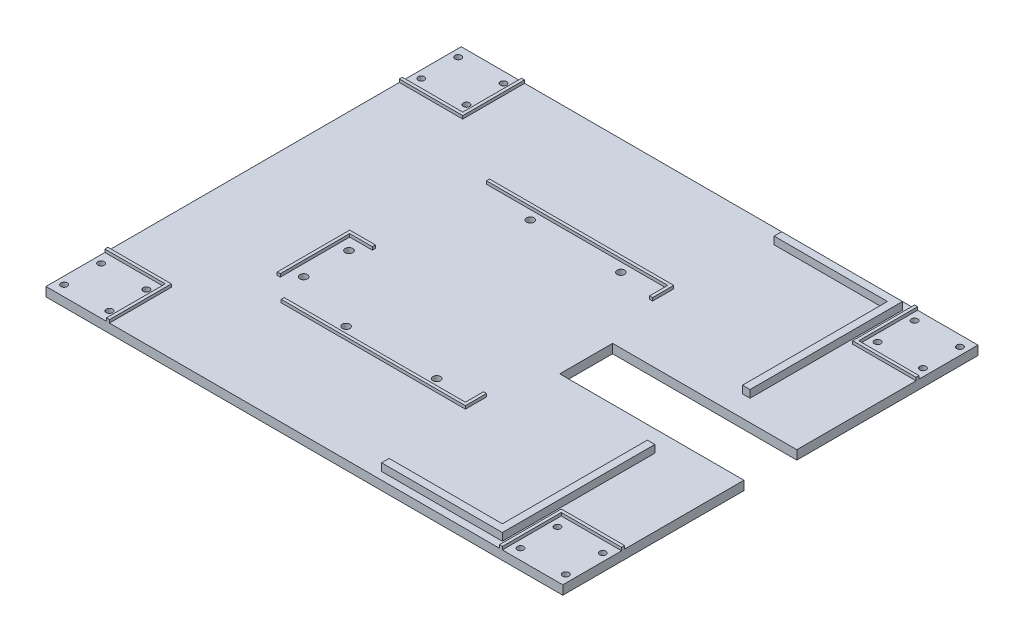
ISO-10303-21;
HEADER;
FILE_DESCRIPTION(('STEP AP214'),'2;1');
FILE_NAME('part.step','',(''),(''),'','','');
FILE_SCHEMA(('AUTOMOTIVE_DESIGN { 1 0 10303 214 1 1 1 1 }'));
ENDSEC;
DATA;
#1=APPLICATION_CONTEXT('core data for automotive mechanical design processes');
#2=APPLICATION_PROTOCOL_DEFINITION('international standard','automotive_design',2000,#1);
#3=PRODUCT_CONTEXT('',#1,'mechanical');
#4=PRODUCT('Part','Part','',(#3));
#5=PRODUCT_RELATED_PRODUCT_CATEGORY('part','',(#4));
#6=PRODUCT_DEFINITION_FORMATION('','',#4);
#7=PRODUCT_DEFINITION_CONTEXT('part definition',#1,'design');
#8=PRODUCT_DEFINITION('design','',#6,#7);
#9=PRODUCT_DEFINITION_SHAPE('','',#8);
#10=(LENGTH_UNIT() NAMED_UNIT(*) SI_UNIT(.MILLI.,.METRE.));
#11=(NAMED_UNIT(*) PLANE_ANGLE_UNIT() SI_UNIT($,.RADIAN.));
#12=(NAMED_UNIT(*) SI_UNIT($,.STERADIAN.) SOLID_ANGLE_UNIT());
#13=UNCERTAINTY_MEASURE_WITH_UNIT(LENGTH_MEASURE(1.E-05),#10,'distance_accuracy_value','');
#14=(GEOMETRIC_REPRESENTATION_CONTEXT(3) GLOBAL_UNCERTAINTY_ASSIGNED_CONTEXT((#13)) GLOBAL_UNIT_ASSIGNED_CONTEXT((#10,
#11,#12)) REPRESENTATION_CONTEXT('',''));
#15=CARTESIAN_POINT('',(0.,0.,0.));
#16=DIRECTION('',(0.,0.,1.));
#17=DIRECTION('',(1.,0.,0.));
#18=AXIS2_PLACEMENT_3D('',#15,#16,#17);
#19=CARTESIAN_POINT('',(0.,6.,0.));
#20=DIRECTION('',(0.,1.,0.));
#21=DIRECTION('',(0.,0.,1.));
#22=AXIS2_PLACEMENT_3D('',#19,#20,#21);
#23=PLANE('',#22);
#24=DIRECTION('',(0.,0.,1.));
#25=VECTOR('',#24,1.);
#26=CARTESIAN_POINT('',(126.12,6.,0.));
#27=LINE('',#26,#25);
#28=CARTESIAN_POINT('',(126.12,6.,-132.5));
#29=VERTEX_POINT('',#28);
#30=CARTESIAN_POINT('',(126.12,6.,-31.5));
#31=VERTEX_POINT('',#30);
#32=EDGE_CURVE('E819',#29,#31,#27,.T.);
#33=ORIENTED_EDGE('',*,*,#32,.T.);
#34=DIRECTION('',(-1.,0.,0.));
#35=VECTOR('',#34,1.);
#36=CARTESIAN_POINT('',(0.,6.,-31.5));
#37=LINE('',#36,#35);
#38=CARTESIAN_POINT('',(121.12,6.,-31.5));
#39=VERTEX_POINT('',#38);
#40=EDGE_CURVE('E888',#31,#39,#37,.T.);
#41=ORIENTED_EDGE('',*,*,#40,.T.);
#42=DIRECTION('',(0.,0.,-1.));
#43=VECTOR('',#42,1.);
#44=CARTESIAN_POINT('',(121.12,6.,0.));
#45=LINE('',#44,#43);
#46=CARTESIAN_POINT('',(121.12,6.,-127.5));
#47=VERTEX_POINT('',#46);
#48=EDGE_CURVE('E920',#39,#47,#45,.T.);
#49=ORIENTED_EDGE('',*,*,#48,.T.);
#50=DIRECTION('',(-1.,0.,0.));
#51=VECTOR('',#50,1.);
#52=CARTESIAN_POINT('',(0.,6.,-127.5));
#53=LINE('',#52,#51);
#54=CARTESIAN_POINT('',(46.1200000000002,6.,-127.5));
#55=VERTEX_POINT('',#54);
#56=EDGE_CURVE('E917',#47,#55,#53,.T.);
#57=ORIENTED_EDGE('',*,*,#56,.T.);
#58=DIRECTION('',(0.,0.,-1.));
#59=VECTOR('',#58,1.);
#60=CARTESIAN_POINT('',(46.1200000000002,6.,0.));
#61=LINE('',#60,#59);
#62=CARTESIAN_POINT('',(46.1200000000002,6.,-132.5));
#63=VERTEX_POINT('',#62);
#64=EDGE_CURVE('E914',#55,#63,#61,.T.);
#65=ORIENTED_EDGE('',*,*,#64,.T.);
#66=DIRECTION('',(1.,0.,0.));
#67=VECTOR('',#66,1.);
#68=CARTESIAN_POINT('',(0.,6.,-132.5));
#69=LINE('',#68,#67);
#70=EDGE_CURVE('E911',#63,#29,#69,.T.);
#71=ORIENTED_EDGE('',*,*,#70,.T.);
#72=EDGE_LOOP('',(#33,#41,#49,#57,#65,#71));
#73=FACE_BOUND('',#72,.T.);
#74=CARTESIAN_POINT('',(-91.3799999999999,6.,46.6));
#75=DIRECTION('',(0.,1.,0.));
#76=DIRECTION('',(0.,0.,1.));
#77=AXIS2_PLACEMENT_3D('',#74,#75,#76);
#78=CIRCLE('',#77,2.5);
#79=CARTESIAN_POINT('',(-91.3799999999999,6.,49.1));
#80=VERTEX_POINT('',#79);
#81=EDGE_CURVE('E985',#80,#80,#78,.T.);
#82=ORIENTED_EDGE('',*,*,#81,.F.);
#83=EDGE_LOOP('',(#82));
#84=FACE_BOUND('',#83,.T.);
#85=CARTESIAN_POINT('',(-91.3799999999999,6.,16.6));
#86=DIRECTION('',(0.,1.,0.));
#87=DIRECTION('',(0.,0.,1.));
#88=AXIS2_PLACEMENT_3D('',#85,#86,#87);
#89=CIRCLE('',#88,2.5);
#90=CARTESIAN_POINT('',(-91.3799999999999,6.,19.1));
#91=VERTEX_POINT('',#90);
#92=EDGE_CURVE('E976',#91,#91,#89,.T.);
#93=ORIENTED_EDGE('',*,*,#92,.F.);
#94=EDGE_LOOP('',(#93));
#95=FACE_BOUND('',#94,.T.);
#96=CARTESIAN_POINT('',(-48.8799999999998,6.,-61.));
#97=DIRECTION('',(0.,1.,0.));
#98=DIRECTION('',(0.,0.,1.));
#99=AXIS2_PLACEMENT_3D('',#96,#97,#98);
#100=CIRCLE('',#99,2.5);
#101=CARTESIAN_POINT('',(-48.8799999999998,6.,-58.5));
#102=VERTEX_POINT('',#101);
#103=EDGE_CURVE('E998',#102,#102,#100,.T.);
#104=ORIENTED_EDGE('',*,*,#103,.F.);
#105=EDGE_LOOP('',(#104));
#106=FACE_BOUND('',#105,.T.);
#107=CARTESIAN_POINT('',(11.1200000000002,6.,61.));
#108=DIRECTION('',(0.,1.,0.));
#109=DIRECTION('',(0.,0.,1.));
#110=AXIS2_PLACEMENT_3D('',#107,#108,#109);
#111=CIRCLE('',#110,2.50000000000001);
#112=CARTESIAN_POINT('',(11.1200000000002,6.,63.5));
#113=VERTEX_POINT('',#112);
#114=EDGE_CURVE('E997',#113,#113,#111,.T.);
#115=ORIENTED_EDGE('',*,*,#114,.F.);
#116=EDGE_LOOP('',(#115));
#117=FACE_BOUND('',#116,.T.);
#118=CARTESIAN_POINT('',(-48.8799999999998,6.,61.));
#119=DIRECTION('',(0.,1.,0.));
#120=DIRECTION('',(0.,0.,1.));
#121=AXIS2_PLACEMENT_3D('',#118,#119,#120);
#122=CIRCLE('',#121,2.5);
#123=CARTESIAN_POINT('',(-48.8799999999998,6.,63.5));
#124=VERTEX_POINT('',#123);
#125=EDGE_CURVE('E993',#124,#124,#122,.T.);
#126=ORIENTED_EDGE('',*,*,#125,.F.);
#127=EDGE_LOOP('',(#126));
#128=FACE_BOUND('',#127,.T.);
#129=CARTESIAN_POINT('',(11.1200000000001,6.,-61.));
#130=DIRECTION('',(0.,1.,0.));
#131=DIRECTION('',(0.,0.,1.));
#132=AXIS2_PLACEMENT_3D('',#129,#130,#131);
#133=CIRCLE('',#132,2.50000000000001);
#134=CARTESIAN_POINT('',(11.1200000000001,6.,-58.5));
#135=VERTEX_POINT('',#134);
#136=EDGE_CURVE('E1002',#135,#135,#133,.T.);
#137=ORIENTED_EDGE('',*,*,#136,.F.);
#138=EDGE_LOOP('',(#137));
#139=FACE_BOUND('',#138,.T.);
#140=DIRECTION('',(0.,0.,1.));
#141=VECTOR('',#140,1.);
#142=CARTESIAN_POINT('',(46.1200000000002,6.,0.));
#143=LINE('',#142,#141);
#144=CARTESIAN_POINT('',(46.1200000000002,6.,127.5));
#145=VERTEX_POINT('',#144);
#146=CARTESIAN_POINT('',(46.1200000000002,6.,132.5));
#147=VERTEX_POINT('',#146);
#148=EDGE_CURVE('E845',#145,#147,#143,.T.);
#149=ORIENTED_EDGE('',*,*,#148,.F.);
#150=DIRECTION('',(-1.,0.,0.));
#151=VECTOR('',#150,1.);
#152=CARTESIAN_POINT('',(0.,6.,127.5));
#153=LINE('',#152,#151);
#154=CARTESIAN_POINT('',(121.12,6.,127.5));
#155=VERTEX_POINT('',#154);
#156=EDGE_CURVE('E841',#155,#145,#153,.T.);
#157=ORIENTED_EDGE('',*,*,#156,.F.);
#158=DIRECTION('',(0.,0.,1.));
#159=VECTOR('',#158,1.);
#160=CARTESIAN_POINT('',(121.12,6.,0.));
#161=LINE('',#160,#159);
#162=CARTESIAN_POINT('',(121.12,6.,31.5));
#163=VERTEX_POINT('',#162);
#164=EDGE_CURVE('E825',#163,#155,#161,.T.);
#165=ORIENTED_EDGE('',*,*,#164,.F.);
#166=DIRECTION('',(-1.,0.,0.));
#167=VECTOR('',#166,1.);
#168=CARTESIAN_POINT('',(0.,6.,31.5));
#169=LINE('',#168,#167);
#170=CARTESIAN_POINT('',(126.12,6.,31.5));
#171=VERTEX_POINT('',#170);
#172=EDGE_CURVE('E855',#171,#163,#169,.T.);
#173=ORIENTED_EDGE('',*,*,#172,.F.);
#174=DIRECTION('',(0.,0.,-1.));
#175=VECTOR('',#174,1.);
#176=CARTESIAN_POINT('',(126.12,6.,0.));
#177=LINE('',#176,#175);
#178=CARTESIAN_POINT('',(126.12,6.,132.5));
#179=VERTEX_POINT('',#178);
#180=EDGE_CURVE('E852',#179,#171,#177,.T.);
#181=ORIENTED_EDGE('',*,*,#180,.F.);
#182=DIRECTION('',(1.,0.,0.));
#183=VECTOR('',#182,1.);
#184=CARTESIAN_POINT('',(0.,6.,132.5));
#185=LINE('',#184,#183);
#186=EDGE_CURVE('E849',#147,#179,#185,.T.);
#187=ORIENTED_EDGE('',*,*,#186,.F.);
#188=EDGE_LOOP('',(#149,#157,#165,#173,#181,#187));
#189=FACE_BOUND('',#188,.T.);
#190=DIRECTION('',(0.,0.,-1.));
#191=VECTOR('',#190,1.);
#192=CARTESIAN_POINT('',(-83.8799999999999,6.,8.60000000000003));
#193=LINE('',#192,#191);
#194=CARTESIAN_POINT('',(-83.8799999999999,6.,8.60000000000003));
#195=VERTEX_POINT('',#194);
#196=CARTESIAN_POINT('',(-83.8799999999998,6.,6.60000000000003));
#197=VERTEX_POINT('',#196);
#198=EDGE_CURVE('E783',#195,#197,#193,.T.);
#199=ORIENTED_EDGE('',*,*,#198,.F.);
#200=DIRECTION('',(1.,0.,0.));
#201=VECTOR('',#200,1.);
#202=CARTESIAN_POINT('',(-83.8799999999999,6.,8.60000000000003));
#203=LINE('',#202,#201);
#204=CARTESIAN_POINT('',(-98.8799999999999,6.,8.60000000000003));
#205=VERTEX_POINT('',#204);
#206=EDGE_CURVE('E758',#205,#195,#203,.T.);
#207=ORIENTED_EDGE('',*,*,#206,.F.);
#208=DIRECTION('',(0.,0.,-1.));
#209=VECTOR('',#208,1.);
#210=CARTESIAN_POINT('',(-98.8799999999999,6.,8.60000000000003));
#211=LINE('',#210,#209);
#212=CARTESIAN_POINT('',(-98.8799999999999,6.,54.6));
#213=VERTEX_POINT('',#212);
#214=EDGE_CURVE('E764',#213,#205,#211,.T.);
#215=ORIENTED_EDGE('',*,*,#214,.F.);
#216=DIRECTION('',(1.,0.,0.));
#217=VECTOR('',#216,1.);
#218=CARTESIAN_POINT('',(-100.88,6.,54.6));
#219=LINE('',#218,#217);
#220=CARTESIAN_POINT('',(-100.88,6.,54.6));
#221=VERTEX_POINT('',#220);
#222=EDGE_CURVE('E792',#221,#213,#219,.T.);
#223=ORIENTED_EDGE('',*,*,#222,.F.);
#224=DIRECTION('',(0.,0.,1.));
#225=VECTOR('',#224,1.);
#226=CARTESIAN_POINT('',(-100.88,6.,6.60000000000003));
#227=LINE('',#226,#225);
#228=CARTESIAN_POINT('',(-100.88,6.,6.60000000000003));
#229=VERTEX_POINT('',#228);
#230=EDGE_CURVE('E789',#229,#221,#227,.T.);
#231=ORIENTED_EDGE('',*,*,#230,.F.);
#232=DIRECTION('',(-1.,0.,0.));
#233=VECTOR('',#232,1.);
#234=CARTESIAN_POINT('',(-83.8799999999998,6.,6.60000000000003));
#235=LINE('',#234,#233);
#236=EDGE_CURVE('E786',#197,#229,#235,.T.);
#237=ORIENTED_EDGE('',*,*,#236,.F.);
#238=EDGE_LOOP('',(#199,#207,#215,#223,#231,#237));
#239=FACE_BOUND('',#238,.T.);
#240=DIRECTION('',(1.,0.,0.));
#241=VECTOR('',#240,1.);
#242=CARTESIAN_POINT('',(129.12,6.,-96.5));
#243=LINE('',#242,#241);
#244=CARTESIAN_POINT('',(129.12,6.,-96.5));
#245=VERTEX_POINT('',#244);
#246=CARTESIAN_POINT('',(171.12,6.,-96.5));
#247=VERTEX_POINT('',#246);
#248=EDGE_CURVE('E673',#245,#247,#243,.T.);
#249=ORIENTED_EDGE('',*,*,#248,.F.);
#250=DIRECTION('',(0.,0.,1.));
#251=VECTOR('',#250,1.);
#252=CARTESIAN_POINT('',(129.12,6.,-137.5));
#253=LINE('',#252,#251);
#254=CARTESIAN_POINT('',(129.12,6.,-137.5));
#255=VERTEX_POINT('',#254);
#256=EDGE_CURVE('E677',#255,#245,#253,.T.);
#257=ORIENTED_EDGE('',*,*,#256,.F.);
#258=DIRECTION('',(1.,0.,0.));
#259=VECTOR('',#258,1.);
#260=CARTESIAN_POINT('',(0.,6.,-137.5));
#261=LINE('',#260,#259);
#262=CARTESIAN_POINT('',(-129.12,6.,-137.5));
#263=VERTEX_POINT('',#262);
#264=EDGE_CURVE('E57',#263,#255,#261,.T.);
#265=ORIENTED_EDGE('',*,*,#264,.F.);
#266=DIRECTION('',(0.,0.,-1.));
#267=VECTOR('',#266,1.);
#268=CARTESIAN_POINT('',(-129.12,6.,-137.5));
#269=LINE('',#268,#267);
#270=CARTESIAN_POINT('',(-129.12,6.,-96.5));
#271=VERTEX_POINT('',#270);
#272=EDGE_CURVE('E711',#271,#263,#269,.T.);
#273=ORIENTED_EDGE('',*,*,#272,.F.);
#274=DIRECTION('',(1.,0.,0.));
#275=VECTOR('',#274,1.);
#276=CARTESIAN_POINT('',(-129.12,6.,-96.5));
#277=LINE('',#276,#275);
#278=CARTESIAN_POINT('',(-171.12,6.,-96.5));
#279=VERTEX_POINT('',#278);
#280=EDGE_CURVE('E733',#279,#271,#277,.T.);
#281=ORIENTED_EDGE('',*,*,#280,.F.);
#282=DIRECTION('',(0.,0.,-1.));
#283=VECTOR('',#282,1.);
#284=CARTESIAN_POINT('',(-171.12,6.,0.));
#285=LINE('',#284,#283);
#286=CARTESIAN_POINT('',(-171.12,6.,96.5));
#287=VERTEX_POINT('',#286);
#288=EDGE_CURVE('E1037',#287,#279,#285,.T.);
#289=ORIENTED_EDGE('',*,*,#288,.F.);
#290=DIRECTION('',(-1.,0.,0.));
#291=VECTOR('',#290,1.);
#292=CARTESIAN_POINT('',(-129.12,6.,96.5));
#293=LINE('',#292,#291);
#294=CARTESIAN_POINT('',(-129.12,6.,96.5));
#295=VERTEX_POINT('',#294);
#296=EDGE_CURVE('E562',#295,#287,#293,.T.);
#297=ORIENTED_EDGE('',*,*,#296,.F.);
#298=DIRECTION('',(0.,0.,-1.));
#299=VECTOR('',#298,1.);
#300=CARTESIAN_POINT('',(-129.12,6.,137.5));
#301=LINE('',#300,#299);
#302=CARTESIAN_POINT('',(-129.12,6.,137.5));
#303=VERTEX_POINT('',#302);
#304=EDGE_CURVE('E566',#303,#295,#301,.T.);
#305=ORIENTED_EDGE('',*,*,#304,.F.);
#306=DIRECTION('',(1.,0.,0.));
#307=VECTOR('',#306,1.);
#308=CARTESIAN_POINT('',(0.,6.,137.5));
#309=LINE('',#308,#307);
#310=CARTESIAN_POINT('',(129.12,6.,137.5));
#311=VERTEX_POINT('',#310);
#312=EDGE_CURVE('E1116',#303,#311,#309,.T.);
#313=ORIENTED_EDGE('',*,*,#312,.T.);
#314=DIRECTION('',(0.,0.,1.));
#315=VECTOR('',#314,1.);
#316=CARTESIAN_POINT('',(129.12,6.,137.5));
#317=LINE('',#316,#315);
#318=CARTESIAN_POINT('',(129.12,6.,96.5));
#319=VERTEX_POINT('',#318);
#320=EDGE_CURVE('E620',#319,#311,#317,.T.);
#321=ORIENTED_EDGE('',*,*,#320,.F.);
#322=DIRECTION('',(-1.,0.,0.));
#323=VECTOR('',#322,1.);
#324=CARTESIAN_POINT('',(129.12,6.,96.5));
#325=LINE('',#324,#323);
#326=CARTESIAN_POINT('',(171.12,6.,96.5));
#327=VERTEX_POINT('',#326);
#328=EDGE_CURVE('E624',#327,#319,#325,.T.);
#329=ORIENTED_EDGE('',*,*,#328,.F.);
#330=DIRECTION('',(0.,0.,-1.));
#331=VECTOR('',#330,1.);
#332=CARTESIAN_POINT('',(171.12,6.,0.));
#333=LINE('',#332,#331);
#334=CARTESIAN_POINT('',(171.12,6.,17.5));
#335=VERTEX_POINT('',#334);
#336=EDGE_CURVE('E1018',#327,#335,#333,.T.);
#337=ORIENTED_EDGE('',*,*,#336,.T.);
#338=DIRECTION('',(-1.,0.,0.));
#339=VECTOR('',#338,1.);
#340=CARTESIAN_POINT('',(171.12,6.,17.5));
#341=LINE('',#340,#339);
#342=CARTESIAN_POINT('',(49.1200000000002,6.,17.5));
#343=VERTEX_POINT('',#342);
#344=EDGE_CURVE('E972',#335,#343,#341,.T.);
#345=ORIENTED_EDGE('',*,*,#344,.T.);
#346=DIRECTION('',(0.,0.,1.));
#347=VECTOR('',#346,1.);
#348=CARTESIAN_POINT('',(49.1200000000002,6.,-17.5));
#349=LINE('',#348,#347);
#350=CARTESIAN_POINT('',(49.1200000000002,6.,-17.5));
#351=VERTEX_POINT('',#350);
#352=EDGE_CURVE('E882',#351,#343,#349,.T.);
#353=ORIENTED_EDGE('',*,*,#352,.F.);
#354=DIRECTION('',(1.,0.,0.));
#355=VECTOR('',#354,1.);
#356=CARTESIAN_POINT('',(49.1200000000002,6.,-17.5));
#357=LINE('',#356,#355);
#358=CARTESIAN_POINT('',(171.12,6.,-17.5));
#359=VERTEX_POINT('',#358);
#360=EDGE_CURVE('E968',#351,#359,#357,.T.);
#361=ORIENTED_EDGE('',*,*,#360,.T.);
#362=EDGE_CURVE('E1019',#359,#247,#333,.T.);
#363=ORIENTED_EDGE('',*,*,#362,.T.);
#364=EDGE_LOOP('',(#249,#257,#265,#273,#281,#289,#297,#305,#313,#321,#329,#337,#345,#353,#361,#363));
#365=FACE_BOUND('',#364,.T.);
#366=DIRECTION('',(1.,0.,0.));
#367=VECTOR('',#366,1.);
#368=CARTESIAN_POINT('',(-83.8799999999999,6.,69.));
#369=LINE('',#368,#367);
#370=CARTESIAN_POINT('',(-83.8799999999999,6.,69.));
#371=VERTEX_POINT('',#370);
#372=CARTESIAN_POINT('',(38.1200000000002,6.,69.));
#373=VERTEX_POINT('',#372);
#374=EDGE_CURVE('E515',#371,#373,#369,.T.);
#375=ORIENTED_EDGE('',*,*,#374,.F.);
#376=DIRECTION('',(0.,0.,1.));
#377=VECTOR('',#376,1.);
#378=CARTESIAN_POINT('',(-83.8799999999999,6.,67.));
#379=LINE('',#378,#377);
#380=CARTESIAN_POINT('',(-83.8799999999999,6.,67.));
#381=VERTEX_POINT('',#380);
#382=EDGE_CURVE('E518',#381,#371,#379,.T.);
#383=ORIENTED_EDGE('',*,*,#382,.F.);
#384=DIRECTION('',(-1.,0.,0.));
#385=VECTOR('',#384,1.);
#386=CARTESIAN_POINT('',(-83.8799999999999,6.,67.));
#387=LINE('',#386,#385);
#388=CARTESIAN_POINT('',(36.1200000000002,6.,67.));
#389=VERTEX_POINT('',#388);
#390=EDGE_CURVE('E502',#389,#381,#387,.T.);
#391=ORIENTED_EDGE('',*,*,#390,.F.);
#392=DIRECTION('',(0.,0.,1.));
#393=VECTOR('',#392,1.);
#394=CARTESIAN_POINT('',(36.1200000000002,6.,67.));
#395=LINE('',#394,#393);
#396=CARTESIAN_POINT('',(36.1200000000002,6.,55.));
#397=VERTEX_POINT('',#396);
#398=EDGE_CURVE('E505',#397,#389,#395,.T.);
#399=ORIENTED_EDGE('',*,*,#398,.F.);
#400=DIRECTION('',(-1.,0.,0.));
#401=VECTOR('',#400,1.);
#402=CARTESIAN_POINT('',(38.1200000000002,6.,55.));
#403=LINE('',#402,#401);
#404=CARTESIAN_POINT('',(38.1200000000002,6.,55.));
#405=VERTEX_POINT('',#404);
#406=EDGE_CURVE('E509',#405,#397,#403,.T.);
#407=ORIENTED_EDGE('',*,*,#406,.F.);
#408=DIRECTION('',(0.,0.,-1.));
#409=VECTOR('',#408,1.);
#410=CARTESIAN_POINT('',(38.1200000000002,6.,69.));
#411=LINE('',#410,#409);
#412=EDGE_CURVE('E512',#373,#405,#411,.T.);
#413=ORIENTED_EDGE('',*,*,#412,.F.);
#414=EDGE_LOOP('',(#375,#383,#391,#399,#407,#413));
#415=FACE_BOUND('',#414,.T.);
#416=DIRECTION('',(1.,0.,0.));
#417=VECTOR('',#416,1.);
#418=CARTESIAN_POINT('',(-83.8799999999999,6.,-67.));
#419=LINE('',#418,#417);
#420=CARTESIAN_POINT('',(-83.8799999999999,6.,-67.));
#421=VERTEX_POINT('',#420);
#422=CARTESIAN_POINT('',(36.1200000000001,6.,-67.));
#423=VERTEX_POINT('',#422);
#424=EDGE_CURVE('E2021',#421,#423,#419,.T.);
#425=ORIENTED_EDGE('',*,*,#424,.F.);
#426=DIRECTION('',(0.,0.,1.));
#427=VECTOR('',#426,1.);
#428=CARTESIAN_POINT('',(-83.8799999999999,6.,-67.));
#429=LINE('',#428,#427);
#430=CARTESIAN_POINT('',(-83.8799999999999,6.,-69.));
#431=VERTEX_POINT('',#430);
#432=EDGE_CURVE('E466',#431,#421,#429,.T.);
#433=ORIENTED_EDGE('',*,*,#432,.F.);
#434=DIRECTION('',(-1.,0.,0.));
#435=VECTOR('',#434,1.);
#436=CARTESIAN_POINT('',(-83.8799999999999,6.,-69.));
#437=LINE('',#436,#435);
#438=CARTESIAN_POINT('',(38.1200000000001,6.,-69.));
#439=VERTEX_POINT('',#438);
#440=EDGE_CURVE('E462',#439,#431,#437,.T.);
#441=ORIENTED_EDGE('',*,*,#440,.F.);
#442=DIRECTION('',(0.,0.,-1.));
#443=VECTOR('',#442,1.);
#444=CARTESIAN_POINT('',(38.1200000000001,6.,-69.));
#445=LINE('',#444,#443);
#446=CARTESIAN_POINT('',(38.1200000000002,6.,-55.));
#447=VERTEX_POINT('',#446);
#448=EDGE_CURVE('E2016',#447,#439,#445,.T.);
#449=ORIENTED_EDGE('',*,*,#448,.F.);
#450=DIRECTION('',(1.,0.,0.));
#451=VECTOR('',#450,1.);
#452=CARTESIAN_POINT('',(38.1200000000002,6.,-55.));
#453=LINE('',#452,#451);
#454=CARTESIAN_POINT('',(36.1200000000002,6.,-55.));
#455=VERTEX_POINT('',#454);
#456=EDGE_CURVE('E2032',#455,#447,#453,.T.);
#457=ORIENTED_EDGE('',*,*,#456,.F.);
#458=DIRECTION('',(0.,0.,1.));
#459=VECTOR('',#458,1.);
#460=CARTESIAN_POINT('',(36.1200000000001,6.,-67.));
#461=LINE('',#460,#459);
#462=EDGE_CURVE('E2025',#423,#455,#461,.T.);
#463=ORIENTED_EDGE('',*,*,#462,.F.);
#464=EDGE_LOOP('',(#425,#433,#441,#449,#457,#463));
#465=FACE_BOUND('',#464,.T.);
#466=ADVANCED_FACE('F47',(#73,#84,#95,#106,#117,#128,#139,#189,#239,#365,#415,#465),#23,.T.);
#467=CARTESIAN_POINT('',(136.12,6.,-130.5));
#468=DIRECTION('',(0.,1.,0.));
#469=DIRECTION('',(0.,0.,1.));
#470=AXIS2_PLACEMENT_3D('',#467,#468,#469);
#471=CIRCLE('',#470,2.09999999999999);
#472=CARTESIAN_POINT('',(136.12,6.,-128.4));
#473=VERTEX_POINT('',#472);
#474=EDGE_CURVE('E1096',#473,#473,#471,.T.);
#475=ORIENTED_EDGE('',*,*,#474,.F.);
#476=EDGE_LOOP('',(#475));
#477=FACE_BOUND('',#476,.T.);
#478=CARTESIAN_POINT('',(166.12,6.,-106.));
#479=DIRECTION('',(0.,1.,0.));
#480=DIRECTION('',(0.,0.,1.));
#481=AXIS2_PLACEMENT_3D('',#478,#479,#480);
#482=CIRCLE('',#481,2.09999999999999);
#483=CARTESIAN_POINT('',(166.12,6.,-103.9));
#484=VERTEX_POINT('',#483);
#485=EDGE_CURVE('E1056',#484,#484,#482,.T.);
#486=ORIENTED_EDGE('',*,*,#485,.F.);
#487=EDGE_LOOP('',(#486));
#488=FACE_BOUND('',#487,.T.);
#489=CARTESIAN_POINT('',(166.12,6.,-130.5));
#490=DIRECTION('',(0.,1.,0.));
#491=DIRECTION('',(0.,0.,1.));
#492=AXIS2_PLACEMENT_3D('',#489,#490,#491);
#493=CIRCLE('',#492,2.09999999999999);
#494=CARTESIAN_POINT('',(166.12,6.,-128.4));
#495=VERTEX_POINT('',#494);
#496=EDGE_CURVE('E1051',#495,#495,#493,.T.);
#497=ORIENTED_EDGE('',*,*,#496,.F.);
#498=EDGE_LOOP('',(#497));
#499=FACE_BOUND('',#498,.T.);
#500=CARTESIAN_POINT('',(136.12,6.,-106.));
#501=DIRECTION('',(0.,1.,0.));
#502=DIRECTION('',(0.,0.,1.));
#503=AXIS2_PLACEMENT_3D('',#500,#501,#502);
#504=CIRCLE('',#503,2.09999999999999);
#505=CARTESIAN_POINT('',(136.12,6.,-103.9));
#506=VERTEX_POINT('',#505);
#507=EDGE_CURVE('E1047',#506,#506,#504,.T.);
#508=ORIENTED_EDGE('',*,*,#507,.F.);
#509=EDGE_LOOP('',(#508));
#510=FACE_BOUND('',#509,.T.);
#511=DIRECTION('',(0.,0.,-1.));
#512=VECTOR('',#511,1.);
#513=CARTESIAN_POINT('',(131.12,6.,-98.5));
#514=LINE('',#513,#512);
#515=CARTESIAN_POINT('',(131.12,6.,-98.5));
#516=VERTEX_POINT('',#515);
#517=CARTESIAN_POINT('',(131.12,6.,-137.5));
#518=VERTEX_POINT('',#517);
#519=EDGE_CURVE('E682',#516,#518,#514,.T.);
#520=ORIENTED_EDGE('',*,*,#519,.F.);
#521=DIRECTION('',(-1.,0.,0.));
#522=VECTOR('',#521,1.);
#523=CARTESIAN_POINT('',(171.12,6.,-98.5));
#524=LINE('',#523,#522);
#525=CARTESIAN_POINT('',(171.12,6.,-98.5));
#526=VERTEX_POINT('',#525);
#527=EDGE_CURVE('E599',#526,#516,#524,.T.);
#528=ORIENTED_EDGE('',*,*,#527,.F.);
#529=CARTESIAN_POINT('',(171.12,6.,-137.5));
#530=VERTEX_POINT('',#529);
#531=EDGE_CURVE('E1043',#526,#530,#333,.T.);
#532=ORIENTED_EDGE('',*,*,#531,.T.);
#533=EDGE_CURVE('E59',#518,#530,#261,.T.);
#534=ORIENTED_EDGE('',*,*,#533,.F.);
#535=EDGE_LOOP('',(#520,#528,#532,#534));
#536=FACE_BOUND('',#535,.T.);
#537=ADVANCED_FACE('F1230',(#477,#488,#499,#510,#536),#23,.T.);
#538=CARTESIAN_POINT('',(136.12,6.,130.5));
#539=DIRECTION('',(0.,1.,0.));
#540=DIRECTION('',(0.,0.,1.));
#541=AXIS2_PLACEMENT_3D('',#538,#539,#540);
#542=CIRCLE('',#541,2.09999999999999);
#543=CARTESIAN_POINT('',(136.12,6.,132.6));
#544=VERTEX_POINT('',#543);
#545=EDGE_CURVE('E1072',#544,#544,#542,.T.);
#546=ORIENTED_EDGE('',*,*,#545,.F.);
#547=EDGE_LOOP('',(#546));
#548=FACE_BOUND('',#547,.T.);
#549=CARTESIAN_POINT('',(136.12,6.,106.));
#550=DIRECTION('',(0.,1.,0.));
#551=DIRECTION('',(0.,0.,1.));
#552=AXIS2_PLACEMENT_3D('',#549,#550,#551);
#553=CIRCLE('',#552,2.09999999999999);
#554=CARTESIAN_POINT('',(136.12,6.,108.1));
#555=VERTEX_POINT('',#554);
#556=EDGE_CURVE('E1076',#555,#555,#553,.T.);
#557=ORIENTED_EDGE('',*,*,#556,.F.);
#558=EDGE_LOOP('',(#557));
#559=FACE_BOUND('',#558,.T.);
#560=CARTESIAN_POINT('',(166.12,6.,130.5));
#561=DIRECTION('',(0.,1.,0.));
#562=DIRECTION('',(0.,0.,1.));
#563=AXIS2_PLACEMENT_3D('',#560,#561,#562);
#564=CIRCLE('',#563,2.09999999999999);
#565=CARTESIAN_POINT('',(166.12,6.,132.6));
#566=VERTEX_POINT('',#565);
#567=EDGE_CURVE('E1080',#566,#566,#564,.T.);
#568=ORIENTED_EDGE('',*,*,#567,.F.);
#569=EDGE_LOOP('',(#568));
#570=FACE_BOUND('',#569,.T.);
#571=CARTESIAN_POINT('',(166.12,6.,106.));
#572=DIRECTION('',(0.,1.,0.));
#573=DIRECTION('',(0.,0.,1.));
#574=AXIS2_PLACEMENT_3D('',#571,#572,#573);
#575=CIRCLE('',#574,2.09999999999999);
#576=CARTESIAN_POINT('',(166.12,6.,108.1));
#577=VERTEX_POINT('',#576);
#578=EDGE_CURVE('E1104',#577,#577,#575,.T.);
#579=ORIENTED_EDGE('',*,*,#578,.F.);
#580=EDGE_LOOP('',(#579));
#581=FACE_BOUND('',#580,.T.);
#582=DIRECTION('',(1.,0.,0.));
#583=VECTOR('',#582,1.);
#584=CARTESIAN_POINT('',(131.12,6.,98.5));
#585=LINE('',#584,#583);
#586=CARTESIAN_POINT('',(131.12,6.,98.5));
#587=VERTEX_POINT('',#586);
#588=CARTESIAN_POINT('',(171.12,6.,98.5));
#589=VERTEX_POINT('',#588);
#590=EDGE_CURVE('E629',#587,#589,#585,.T.);
#591=ORIENTED_EDGE('',*,*,#590,.F.);
#592=DIRECTION('',(0.,0.,-1.));
#593=VECTOR('',#592,1.);
#594=CARTESIAN_POINT('',(131.12,6.,137.5));
#595=LINE('',#594,#593);
#596=CARTESIAN_POINT('',(131.12,6.,137.5));
#597=VERTEX_POINT('',#596);
#598=EDGE_CURVE('E543',#597,#587,#595,.T.);
#599=ORIENTED_EDGE('',*,*,#598,.F.);
#600=CARTESIAN_POINT('',(171.12,6.,137.5));
#601=VERTEX_POINT('',#600);
#602=EDGE_CURVE('E1112',#597,#601,#309,.T.);
#603=ORIENTED_EDGE('',*,*,#602,.T.);
#604=EDGE_CURVE('E1015',#601,#589,#333,.T.);
#605=ORIENTED_EDGE('',*,*,#604,.T.);
#606=EDGE_LOOP('',(#591,#599,#603,#605));
#607=FACE_BOUND('',#606,.T.);
#608=ADVANCED_FACE('F1233',(#548,#559,#570,#581,#607),#23,.T.);
#609=CARTESIAN_POINT('',(-166.12,6.,130.5));
#610=DIRECTION('',(0.,1.,0.));
#611=DIRECTION('',(0.,0.,1.));
#612=AXIS2_PLACEMENT_3D('',#609,#610,#611);
#613=CIRCLE('',#612,2.09999999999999);
#614=CARTESIAN_POINT('',(-166.12,6.,132.6));
#615=VERTEX_POINT('',#614);
#616=EDGE_CURVE('E1100',#615,#615,#613,.T.);
#617=ORIENTED_EDGE('',*,*,#616,.F.);
#618=EDGE_LOOP('',(#617));
#619=FACE_BOUND('',#618,.T.);
#620=CARTESIAN_POINT('',(-166.12,6.,106.));
#621=DIRECTION('',(0.,1.,0.));
#622=DIRECTION('',(0.,0.,1.));
#623=AXIS2_PLACEMENT_3D('',#620,#621,#622);
#624=CIRCLE('',#623,2.09999999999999);
#625=CARTESIAN_POINT('',(-166.12,6.,108.1));
#626=VERTEX_POINT('',#625);
#627=EDGE_CURVE('E1068',#626,#626,#624,.T.);
#628=ORIENTED_EDGE('',*,*,#627,.F.);
#629=EDGE_LOOP('',(#628));
#630=FACE_BOUND('',#629,.T.);
#631=CARTESIAN_POINT('',(-136.12,6.,130.5));
#632=DIRECTION('',(0.,1.,0.));
#633=DIRECTION('',(0.,0.,1.));
#634=AXIS2_PLACEMENT_3D('',#631,#632,#633);
#635=CIRCLE('',#634,2.09999999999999);
#636=CARTESIAN_POINT('',(-136.12,6.,132.6));
#637=VERTEX_POINT('',#636);
#638=EDGE_CURVE('E1064',#637,#637,#635,.T.);
#639=ORIENTED_EDGE('',*,*,#638,.F.);
#640=EDGE_LOOP('',(#639));
#641=FACE_BOUND('',#640,.T.);
#642=CARTESIAN_POINT('',(-136.12,6.,106.));
#643=DIRECTION('',(0.,1.,0.));
#644=DIRECTION('',(0.,0.,1.));
#645=AXIS2_PLACEMENT_3D('',#642,#643,#644);
#646=CIRCLE('',#645,2.09999999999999);
#647=CARTESIAN_POINT('',(-136.12,6.,108.1));
#648=VERTEX_POINT('',#647);
#649=EDGE_CURVE('E1060',#648,#648,#646,.T.);
#650=ORIENTED_EDGE('',*,*,#649,.F.);
#651=EDGE_LOOP('',(#650));
#652=FACE_BOUND('',#651,.T.);
#653=DIRECTION('',(0.,0.,1.));
#654=VECTOR('',#653,1.);
#655=CARTESIAN_POINT('',(-131.12,6.,98.5));
#656=LINE('',#655,#654);
#657=CARTESIAN_POINT('',(-131.12,6.,98.5));
#658=VERTEX_POINT('',#657);
#659=CARTESIAN_POINT('',(-131.12,6.,137.5));
#660=VERTEX_POINT('',#659);
#661=EDGE_CURVE('E570',#658,#660,#656,.T.);
#662=ORIENTED_EDGE('',*,*,#661,.F.);
#663=DIRECTION('',(1.,0.,0.));
#664=VECTOR('',#663,1.);
#665=CARTESIAN_POINT('',(-171.12,6.,98.5));
#666=LINE('',#665,#664);
#667=CARTESIAN_POINT('',(-171.12,6.,98.5));
#668=VERTEX_POINT('',#667);
#669=EDGE_CURVE('E573',#668,#658,#666,.T.);
#670=ORIENTED_EDGE('',*,*,#669,.F.);
#671=CARTESIAN_POINT('',(-171.12,6.,137.5));
#672=VERTEX_POINT('',#671);
#673=EDGE_CURVE('E1033',#672,#668,#285,.T.);
#674=ORIENTED_EDGE('',*,*,#673,.F.);
#675=EDGE_CURVE('E1113',#672,#660,#309,.T.);
#676=ORIENTED_EDGE('',*,*,#675,.T.);
#677=EDGE_LOOP('',(#662,#670,#674,#676));
#678=FACE_BOUND('',#677,.T.);
#679=ADVANCED_FACE('F1245',(#619,#630,#641,#652,#678),#23,.T.);
#680=CARTESIAN_POINT('',(-166.12,6.,-106.));
#681=DIRECTION('',(0.,1.,0.));
#682=DIRECTION('',(0.,0.,1.));
#683=AXIS2_PLACEMENT_3D('',#680,#681,#682);
#684=CIRCLE('',#683,2.09999999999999);
#685=CARTESIAN_POINT('',(-166.12,6.,-103.9));
#686=VERTEX_POINT('',#685);
#687=EDGE_CURVE('E1084',#686,#686,#684,.T.);
#688=ORIENTED_EDGE('',*,*,#687,.F.);
#689=EDGE_LOOP('',(#688));
#690=FACE_BOUND('',#689,.T.);
#691=CARTESIAN_POINT('',(-136.12,6.,-130.5));
#692=DIRECTION('',(0.,1.,0.));
#693=DIRECTION('',(0.,0.,1.));
#694=AXIS2_PLACEMENT_3D('',#691,#692,#693);
#695=CIRCLE('',#694,2.09999999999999);
#696=CARTESIAN_POINT('',(-136.12,6.,-128.4));
#697=VERTEX_POINT('',#696);
#698=EDGE_CURVE('E1088',#697,#697,#695,.T.);
#699=ORIENTED_EDGE('',*,*,#698,.F.);
#700=EDGE_LOOP('',(#699));
#701=FACE_BOUND('',#700,.T.);
#702=CARTESIAN_POINT('',(-136.12,6.,-106.));
#703=DIRECTION('',(0.,1.,0.));
#704=DIRECTION('',(0.,0.,1.));
#705=AXIS2_PLACEMENT_3D('',#702,#703,#704);
#706=CIRCLE('',#705,2.09999999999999);
#707=CARTESIAN_POINT('',(-136.12,6.,-103.9));
#708=VERTEX_POINT('',#707);
#709=EDGE_CURVE('E1092',#708,#708,#706,.T.);
#710=ORIENTED_EDGE('',*,*,#709,.F.);
#711=EDGE_LOOP('',(#710));
#712=FACE_BOUND('',#711,.T.);
#713=CARTESIAN_POINT('',(-166.12,6.,-130.5));
#714=DIRECTION('',(0.,1.,0.));
#715=DIRECTION('',(0.,0.,1.));
#716=AXIS2_PLACEMENT_3D('',#713,#714,#715);
#717=CIRCLE('',#716,2.09999999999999);
#718=CARTESIAN_POINT('',(-166.12,6.,-128.4));
#719=VERTEX_POINT('',#718);
#720=EDGE_CURVE('E1108',#719,#719,#717,.T.);
#721=ORIENTED_EDGE('',*,*,#720,.F.);
#722=EDGE_LOOP('',(#721));
#723=FACE_BOUND('',#722,.T.);
#724=DIRECTION('',(-1.,0.,0.));
#725=VECTOR('',#724,1.);
#726=CARTESIAN_POINT('',(-131.12,6.,-98.5));
#727=LINE('',#726,#725);
#728=CARTESIAN_POINT('',(-131.12,6.,-98.5));
#729=VERTEX_POINT('',#728);
#730=CARTESIAN_POINT('',(-171.12,6.,-98.5));
#731=VERTEX_POINT('',#730);
#732=EDGE_CURVE('E729',#729,#731,#727,.T.);
#733=ORIENTED_EDGE('',*,*,#732,.F.);
#734=DIRECTION('',(0.,0.,1.));
#735=VECTOR('',#734,1.);
#736=CARTESIAN_POINT('',(-131.12,6.,-137.5));
#737=LINE('',#736,#735);
#738=CARTESIAN_POINT('',(-131.12,6.,-137.5));
#739=VERTEX_POINT('',#738);
#740=EDGE_CURVE('E576',#739,#729,#737,.T.);
#741=ORIENTED_EDGE('',*,*,#740,.F.);
#742=CARTESIAN_POINT('',(-171.12,6.,-137.5));
#743=VERTEX_POINT('',#742);
#744=EDGE_CURVE('E11',#743,#739,#261,.T.);
#745=ORIENTED_EDGE('',*,*,#744,.F.);
#746=EDGE_CURVE('E1038',#731,#743,#285,.T.);
#747=ORIENTED_EDGE('',*,*,#746,.F.);
#748=EDGE_LOOP('',(#733,#741,#745,#747));
#749=FACE_BOUND('',#748,.T.);
#750=ADVANCED_FACE('F1240',(#690,#701,#712,#723,#749),#23,.T.);
#751=CARTESIAN_POINT('',(171.12,0.,0.));
#752=DIRECTION('',(1.,0.,0.));
#753=DIRECTION('',(0.,0.,-1.));
#754=AXIS2_PLACEMENT_3D('',#751,#752,#753);
#755=PLANE('',#754);
#756=DIRECTION('',(0.,0.,-1.));
#757=VECTOR('',#756,1.);
#758=CARTESIAN_POINT('',(171.12,0.,0.));
#759=LINE('',#758,#757);
#760=CARTESIAN_POINT('',(171.12,0.,137.5));
#761=VERTEX_POINT('',#760);
#762=CARTESIAN_POINT('',(171.12,0.,17.5));
#763=VERTEX_POINT('',#762);
#764=EDGE_CURVE('E1010',#761,#763,#759,.T.);
#765=ORIENTED_EDGE('',*,*,#764,.T.);
#766=DIRECTION('',(0.,1.,0.));
#767=VECTOR('',#766,1.);
#768=CARTESIAN_POINT('',(171.12,0.,17.5));
#769=LINE('',#768,#767);
#770=EDGE_CURVE('E959',#763,#335,#769,.T.);
#771=ORIENTED_EDGE('',*,*,#770,.T.);
#772=ORIENTED_EDGE('',*,*,#336,.F.);
#773=DIRECTION('',(0.,-1.,0.));
#774=VECTOR('',#773,1.);
#775=CARTESIAN_POINT('',(171.12,8.,96.5));
#776=LINE('',#775,#774);
#777=CARTESIAN_POINT('',(171.12,8.,96.5));
#778=VERTEX_POINT('',#777);
#779=EDGE_CURVE('E607',#778,#327,#776,.T.);
#780=ORIENTED_EDGE('',*,*,#779,.F.);
#781=DIRECTION('',(0.,0.,-1.));
#782=VECTOR('',#781,1.);
#783=CARTESIAN_POINT('',(171.12,8.,96.5));
#784=LINE('',#783,#782);
#785=CARTESIAN_POINT('',(171.12,8.,98.5));
#786=VERTEX_POINT('',#785);
#787=EDGE_CURVE('E641',#786,#778,#784,.T.);
#788=ORIENTED_EDGE('',*,*,#787,.F.);
#789=DIRECTION('',(0.,-1.,0.));
#790=VECTOR('',#789,1.);
#791=CARTESIAN_POINT('',(171.12,8.,98.5));
#792=LINE('',#791,#790);
#793=EDGE_CURVE('E603',#786,#589,#792,.T.);
#794=ORIENTED_EDGE('',*,*,#793,.T.);
#795=ORIENTED_EDGE('',*,*,#604,.F.);
#796=DIRECTION('',(0.,1.,0.));
#797=VECTOR('',#796,1.);
#798=CARTESIAN_POINT('',(171.12,0.,137.5));
#799=LINE('',#798,#797);
#800=EDGE_CURVE('E1013',#761,#601,#799,.T.);
#801=ORIENTED_EDGE('',*,*,#800,.F.);
#802=EDGE_LOOP('',(#765,#771,#772,#780,#788,#794,#795,#801));
#803=FACE_BOUND('',#802,.T.);
#804=ADVANCED_FACE('F1295',(#803),#755,.T.);
#805=CARTESIAN_POINT('',(0.,6.,137.5));
#806=DIRECTION('',(0.,0.,-1.));
#807=DIRECTION('',(-1.,0.,0.));
#808=AXIS2_PLACEMENT_3D('',#805,#806,#807);
#809=PLANE('',#808);
#810=ORIENTED_EDGE('',*,*,#800,.T.);
#811=ORIENTED_EDGE('',*,*,#602,.F.);
#812=DIRECTION('',(0.,-1.,0.));
#813=VECTOR('',#812,1.);
#814=CARTESIAN_POINT('',(131.12,8.,137.5));
#815=LINE('',#814,#813);
#816=CARTESIAN_POINT('',(131.12,8.,137.5));
#817=VERTEX_POINT('',#816);
#818=EDGE_CURVE('E594',#817,#597,#815,.T.);
#819=ORIENTED_EDGE('',*,*,#818,.F.);
#820=DIRECTION('',(1.,0.,0.));
#821=VECTOR('',#820,1.);
#822=CARTESIAN_POINT('',(131.12,8.,137.5));
#823=LINE('',#822,#821);
#824=CARTESIAN_POINT('',(129.12,8.,137.5));
#825=VERTEX_POINT('',#824);
#826=EDGE_CURVE('E625',#825,#817,#823,.T.);
#827=ORIENTED_EDGE('',*,*,#826,.F.);
#828=DIRECTION('',(0.,-1.,0.));
#829=VECTOR('',#828,1.);
#830=CARTESIAN_POINT('',(129.12,8.,137.5));
#831=LINE('',#830,#829);
#832=EDGE_CURVE('E615',#825,#311,#831,.T.);
#833=ORIENTED_EDGE('',*,*,#832,.T.);
#834=ORIENTED_EDGE('',*,*,#312,.F.);
#835=DIRECTION('',(0.,-1.,0.));
#836=VECTOR('',#835,1.);
#837=CARTESIAN_POINT('',(-129.12,8.,137.5));
#838=LINE('',#837,#836);
#839=CARTESIAN_POINT('',(-129.12,8.,137.5));
#840=VERTEX_POINT('',#839);
#841=EDGE_CURVE('E551',#840,#303,#838,.T.);
#842=ORIENTED_EDGE('',*,*,#841,.F.);
#843=DIRECTION('',(1.,0.,0.));
#844=VECTOR('',#843,1.);
#845=CARTESIAN_POINT('',(-131.12,8.,137.5));
#846=LINE('',#845,#844);
#847=CARTESIAN_POINT('',(-131.12,8.,137.5));
#848=VERTEX_POINT('',#847);
#849=EDGE_CURVE('E582',#848,#840,#846,.T.);
#850=ORIENTED_EDGE('',*,*,#849,.F.);
#851=DIRECTION('',(0.,-1.,0.));
#852=VECTOR('',#851,1.);
#853=CARTESIAN_POINT('',(-131.12,8.,137.5));
#854=LINE('',#853,#852);
#855=EDGE_CURVE('E547',#848,#660,#854,.T.);
#856=ORIENTED_EDGE('',*,*,#855,.T.);
#857=ORIENTED_EDGE('',*,*,#675,.F.);
#858=DIRECTION('',(0.,1.,0.));
#859=VECTOR('',#858,1.);
#860=CARTESIAN_POINT('',(-171.12,0.,137.5));
#861=LINE('',#860,#859);
#862=CARTESIAN_POINT('',(-171.12,0.,137.5));
#863=VERTEX_POINT('',#862);
#864=EDGE_CURVE('E1039',#863,#672,#861,.T.);
#865=ORIENTED_EDGE('',*,*,#864,.F.);
#866=DIRECTION('',(1.,0.,0.));
#867=VECTOR('',#866,1.);
#868=CARTESIAN_POINT('',(0.,0.,137.5));
#869=LINE('',#868,#867);
#870=EDGE_CURVE('E1181',#863,#761,#869,.T.);
#871=ORIENTED_EDGE('',*,*,#870,.T.);
#872=EDGE_LOOP('',(#810,#811,#819,#827,#833,#834,#842,#850,#856,#857,#865,#871));
#873=FACE_BOUND('',#872,.T.);
#874=ADVANCED_FACE('F1277',(#873),#809,.F.);
#875=CARTESIAN_POINT('',(0.,6.,-137.5));
#876=DIRECTION('',(0.,0.,-1.));
#877=DIRECTION('',(-1.,0.,0.));
#878=AXIS2_PLACEMENT_3D('',#875,#876,#877);
#879=PLANE('',#878);
#880=DIRECTION('',(0.,1.,0.));
#881=VECTOR('',#880,1.);
#882=CARTESIAN_POINT('',(171.12,0.,-137.5));
#883=LINE('',#882,#881);
#884=CARTESIAN_POINT('',(171.12,0.,-137.5));
#885=VERTEX_POINT('',#884);
#886=EDGE_CURVE('E1020',#885,#530,#883,.T.);
#887=ORIENTED_EDGE('',*,*,#886,.F.);
#888=DIRECTION('',(1.,0.,0.));
#889=VECTOR('',#888,1.);
#890=CARTESIAN_POINT('',(0.,0.,-137.5));
#891=LINE('',#890,#889);
#892=CARTESIAN_POINT('',(-171.12,0.,-137.5));
#893=VERTEX_POINT('',#892);
#894=EDGE_CURVE('E1052',#893,#885,#891,.T.);
#895=ORIENTED_EDGE('',*,*,#894,.F.);
#896=DIRECTION('',(0.,1.,0.));
#897=VECTOR('',#896,1.);
#898=CARTESIAN_POINT('',(-171.12,0.,-137.5));
#899=LINE('',#898,#897);
#900=EDGE_CURVE('E1032',#893,#743,#899,.T.);
#901=ORIENTED_EDGE('',*,*,#900,.T.);
#902=ORIENTED_EDGE('',*,*,#744,.T.);
#903=DIRECTION('',(0.,-1.,0.));
#904=VECTOR('',#903,1.);
#905=CARTESIAN_POINT('',(-131.12,8.,-137.5));
#906=LINE('',#905,#904);
#907=CARTESIAN_POINT('',(-131.12,8.,-137.5));
#908=VERTEX_POINT('',#907);
#909=EDGE_CURVE('E755',#908,#739,#906,.T.);
#910=ORIENTED_EDGE('',*,*,#909,.F.);
#911=DIRECTION('',(-1.,0.,0.));
#912=VECTOR('',#911,1.);
#913=CARTESIAN_POINT('',(-131.12,8.,-137.5));
#914=LINE('',#913,#912);
#915=CARTESIAN_POINT('',(-129.12,8.,-137.5));
#916=VERTEX_POINT('',#915);
#917=EDGE_CURVE('E706',#916,#908,#914,.T.);
#918=ORIENTED_EDGE('',*,*,#917,.F.);
#919=DIRECTION('',(0.,-1.,0.));
#920=VECTOR('',#919,1.);
#921=CARTESIAN_POINT('',(-129.12,8.,-137.5));
#922=LINE('',#921,#920);
#923=EDGE_CURVE('E726',#916,#263,#922,.T.);
#924=ORIENTED_EDGE('',*,*,#923,.T.);
#925=ORIENTED_EDGE('',*,*,#264,.T.);
#926=DIRECTION('',(0.,-1.,0.));
#927=VECTOR('',#926,1.);
#928=CARTESIAN_POINT('',(129.12,8.,-137.5));
#929=LINE('',#928,#927);
#930=CARTESIAN_POINT('',(129.12,8.,-137.5));
#931=VERTEX_POINT('',#930);
#932=EDGE_CURVE('E660',#931,#255,#929,.T.);
#933=ORIENTED_EDGE('',*,*,#932,.F.);
#934=DIRECTION('',(-1.,0.,0.));
#935=VECTOR('',#934,1.);
#936=CARTESIAN_POINT('',(131.12,8.,-137.5));
#937=LINE('',#936,#935);
#938=CARTESIAN_POINT('',(131.12,8.,-137.5));
#939=VERTEX_POINT('',#938);
#940=EDGE_CURVE('E694',#939,#931,#937,.T.);
#941=ORIENTED_EDGE('',*,*,#940,.F.);
#942=DIRECTION('',(0.,-1.,0.));
#943=VECTOR('',#942,1.);
#944=CARTESIAN_POINT('',(131.12,8.,-137.5));
#945=LINE('',#944,#943);
#946=EDGE_CURVE('E656',#939,#518,#945,.T.);
#947=ORIENTED_EDGE('',*,*,#946,.T.);
#948=ORIENTED_EDGE('',*,*,#533,.T.);
#949=EDGE_LOOP('',(#887,#895,#901,#902,#910,#918,#924,#925,#933,#941,#947,#948));
#950=FACE_BOUND('',#949,.T.);
#951=ADVANCED_FACE('F1310',(#950),#879,.T.);
#952=CARTESIAN_POINT('',(-166.12,6.,-130.5));
#953=DIRECTION('',(0.,-1.,0.));
#954=DIRECTION('',(0.,0.,-1.));
#955=AXIS2_PLACEMENT_3D('',#952,#953,#954);
#956=CYLINDRICAL_SURFACE('',#955,2.09999999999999);
#957=ORIENTED_EDGE('',*,*,#720,.T.);
#958=EDGE_LOOP('',(#957));
#959=FACE_BOUND('',#958,.T.);
#960=CARTESIAN_POINT('',(-166.12,0.,-130.5));
#961=DIRECTION('',(0.,1.,0.));
#962=DIRECTION('',(0.,0.,1.));
#963=AXIS2_PLACEMENT_3D('',#960,#961,#962);
#964=CIRCLE('',#963,2.09999999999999);
#965=CARTESIAN_POINT('',(-166.12,0.,-128.4));
#966=VERTEX_POINT('',#965);
#967=EDGE_CURVE('E1177',#966,#966,#964,.T.);
#968=ORIENTED_EDGE('',*,*,#967,.F.);
#969=EDGE_LOOP('',(#968));
#970=FACE_BOUND('',#969,.T.);
#971=ADVANCED_FACE('F1697',(#959,#970),#956,.F.);
#972=CARTESIAN_POINT('',(166.12,6.,106.));
#973=DIRECTION('',(0.,-1.,0.));
#974=DIRECTION('',(0.,0.,-1.));
#975=AXIS2_PLACEMENT_3D('',#972,#973,#974);
#976=CYLINDRICAL_SURFACE('',#975,2.09999999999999);
#977=ORIENTED_EDGE('',*,*,#578,.T.);
#978=EDGE_LOOP('',(#977));
#979=FACE_BOUND('',#978,.T.);
#980=CARTESIAN_POINT('',(166.12,0.,106.));
#981=DIRECTION('',(0.,1.,0.));
#982=DIRECTION('',(0.,0.,1.));
#983=AXIS2_PLACEMENT_3D('',#980,#981,#982);
#984=CIRCLE('',#983,2.09999999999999);
#985=CARTESIAN_POINT('',(166.12,0.,108.1));
#986=VERTEX_POINT('',#985);
#987=EDGE_CURVE('E1173',#986,#986,#984,.T.);
#988=ORIENTED_EDGE('',*,*,#987,.F.);
#989=EDGE_LOOP('',(#988));
#990=FACE_BOUND('',#989,.T.);
#991=ADVANCED_FACE('F2304',(#979,#990),#976,.F.);
#992=CARTESIAN_POINT('',(-166.12,6.,130.5));
#993=DIRECTION('',(0.,-1.,0.));
#994=DIRECTION('',(0.,0.,-1.));
#995=AXIS2_PLACEMENT_3D('',#992,#993,#994);
#996=CYLINDRICAL_SURFACE('',#995,2.09999999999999);
#997=ORIENTED_EDGE('',*,*,#616,.T.);
#998=EDGE_LOOP('',(#997));
#999=FACE_BOUND('',#998,.T.);
#1000=CARTESIAN_POINT('',(-166.12,0.,130.5));
#1001=DIRECTION('',(0.,1.,0.));
#1002=DIRECTION('',(0.,0.,1.));
#1003=AXIS2_PLACEMENT_3D('',#1000,#1001,#1002);
#1004=CIRCLE('',#1003,2.09999999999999);
#1005=CARTESIAN_POINT('',(-166.12,0.,132.6));
#1006=VERTEX_POINT('',#1005);
#1007=EDGE_CURVE('E1169',#1006,#1006,#1004,.T.);
#1008=ORIENTED_EDGE('',*,*,#1007,.F.);
#1009=EDGE_LOOP('',(#1008));
#1010=FACE_BOUND('',#1009,.T.);
#1011=ADVANCED_FACE('F2295',(#999,#1010),#996,.F.);
#1012=CARTESIAN_POINT('',(136.12,6.,-130.5));
#1013=DIRECTION('',(0.,-1.,0.));
#1014=DIRECTION('',(0.,0.,-1.));
#1015=AXIS2_PLACEMENT_3D('',#1012,#1013,#1014);
#1016=CYLINDRICAL_SURFACE('',#1015,2.09999999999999);
#1017=ORIENTED_EDGE('',*,*,#474,.T.);
#1018=EDGE_LOOP('',(#1017));
#1019=FACE_BOUND('',#1018,.T.);
#1020=CARTESIAN_POINT('',(136.12,0.,-130.5));
#1021=DIRECTION('',(0.,1.,0.));
#1022=DIRECTION('',(0.,0.,1.));
#1023=AXIS2_PLACEMENT_3D('',#1020,#1021,#1022);
#1024=CIRCLE('',#1023,2.09999999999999);
#1025=CARTESIAN_POINT('',(136.12,0.,-128.4));
#1026=VERTEX_POINT('',#1025);
#1027=EDGE_CURVE('E1165',#1026,#1026,#1024,.T.);
#1028=ORIENTED_EDGE('',*,*,#1027,.F.);
#1029=EDGE_LOOP('',(#1028));
#1030=FACE_BOUND('',#1029,.T.);
#1031=ADVANCED_FACE('F2286',(#1019,#1030),#1016,.F.);
#1032=CARTESIAN_POINT('',(-136.12,6.,-106.));
#1033=DIRECTION('',(0.,-1.,0.));
#1034=DIRECTION('',(0.,0.,-1.));
#1035=AXIS2_PLACEMENT_3D('',#1032,#1033,#1034);
#1036=CYLINDRICAL_SURFACE('',#1035,2.09999999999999);
#1037=ORIENTED_EDGE('',*,*,#709,.T.);
#1038=EDGE_LOOP('',(#1037));
#1039=FACE_BOUND('',#1038,.T.);
#1040=CARTESIAN_POINT('',(-136.12,0.,-106.));
#1041=DIRECTION('',(0.,1.,0.));
#1042=DIRECTION('',(0.,0.,1.));
#1043=AXIS2_PLACEMENT_3D('',#1040,#1041,#1042);
#1044=CIRCLE('',#1043,2.09999999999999);
#1045=CARTESIAN_POINT('',(-136.12,0.,-103.9));
#1046=VERTEX_POINT('',#1045);
#1047=EDGE_CURVE('E1161',#1046,#1046,#1044,.T.);
#1048=ORIENTED_EDGE('',*,*,#1047,.F.);
#1049=EDGE_LOOP('',(#1048));
#1050=FACE_BOUND('',#1049,.T.);
#1051=ADVANCED_FACE('F2277',(#1039,#1050),#1036,.F.);
#1052=CARTESIAN_POINT('',(-136.12,6.,-130.5));
#1053=DIRECTION('',(0.,-1.,0.));
#1054=DIRECTION('',(0.,0.,-1.));
#1055=AXIS2_PLACEMENT_3D('',#1052,#1053,#1054);
#1056=CYLINDRICAL_SURFACE('',#1055,2.09999999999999);
#1057=ORIENTED_EDGE('',*,*,#698,.T.);
#1058=EDGE_LOOP('',(#1057));
#1059=FACE_BOUND('',#1058,.T.);
#1060=CARTESIAN_POINT('',(-136.12,0.,-130.5));
#1061=DIRECTION('',(0.,1.,0.));
#1062=DIRECTION('',(0.,0.,1.));
#1063=AXIS2_PLACEMENT_3D('',#1060,#1061,#1062);
#1064=CIRCLE('',#1063,2.09999999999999);
#1065=CARTESIAN_POINT('',(-136.12,0.,-128.4));
#1066=VERTEX_POINT('',#1065);
#1067=EDGE_CURVE('E1157',#1066,#1066,#1064,.T.);
#1068=ORIENTED_EDGE('',*,*,#1067,.F.);
#1069=EDGE_LOOP('',(#1068));
#1070=FACE_BOUND('',#1069,.T.);
#1071=ADVANCED_FACE('F2268',(#1059,#1070),#1056,.F.);
#1072=CARTESIAN_POINT('',(-166.12,6.,-106.));
#1073=DIRECTION('',(0.,-1.,0.));
#1074=DIRECTION('',(0.,0.,-1.));
#1075=AXIS2_PLACEMENT_3D('',#1072,#1073,#1074);
#1076=CYLINDRICAL_SURFACE('',#1075,2.09999999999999);
#1077=ORIENTED_EDGE('',*,*,#687,.T.);
#1078=EDGE_LOOP('',(#1077));
#1079=FACE_BOUND('',#1078,.T.);
#1080=CARTESIAN_POINT('',(-166.12,0.,-106.));
#1081=DIRECTION('',(0.,1.,0.));
#1082=DIRECTION('',(0.,0.,1.));
#1083=AXIS2_PLACEMENT_3D('',#1080,#1081,#1082);
#1084=CIRCLE('',#1083,2.09999999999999);
#1085=CARTESIAN_POINT('',(-166.12,0.,-103.9));
#1086=VERTEX_POINT('',#1085);
#1087=EDGE_CURVE('E1153',#1086,#1086,#1084,.T.);
#1088=ORIENTED_EDGE('',*,*,#1087,.F.);
#1089=EDGE_LOOP('',(#1088));
#1090=FACE_BOUND('',#1089,.T.);
#1091=ADVANCED_FACE('F2259',(#1079,#1090),#1076,.F.);
#1092=CARTESIAN_POINT('',(166.12,6.,130.5));
#1093=DIRECTION('',(0.,-1.,0.));
#1094=DIRECTION('',(0.,0.,-1.));
#1095=AXIS2_PLACEMENT_3D('',#1092,#1093,#1094);
#1096=CYLINDRICAL_SURFACE('',#1095,2.09999999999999);
#1097=ORIENTED_EDGE('',*,*,#567,.T.);
#1098=EDGE_LOOP('',(#1097));
#1099=FACE_BOUND('',#1098,.T.);
#1100=CARTESIAN_POINT('',(166.12,0.,130.5));
#1101=DIRECTION('',(0.,1.,0.));
#1102=DIRECTION('',(0.,0.,1.));
#1103=AXIS2_PLACEMENT_3D('',#1100,#1101,#1102);
#1104=CIRCLE('',#1103,2.09999999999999);
#1105=CARTESIAN_POINT('',(166.12,0.,132.6));
#1106=VERTEX_POINT('',#1105);
#1107=EDGE_CURVE('E1149',#1106,#1106,#1104,.T.);
#1108=ORIENTED_EDGE('',*,*,#1107,.F.);
#1109=EDGE_LOOP('',(#1108));
#1110=FACE_BOUND('',#1109,.T.);
#1111=ADVANCED_FACE('F2250',(#1099,#1110),#1096,.F.);
#1112=CARTESIAN_POINT('',(136.12,6.,106.));
#1113=DIRECTION('',(0.,-1.,0.));
#1114=DIRECTION('',(0.,0.,-1.));
#1115=AXIS2_PLACEMENT_3D('',#1112,#1113,#1114);
#1116=CYLINDRICAL_SURFACE('',#1115,2.09999999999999);
#1117=ORIENTED_EDGE('',*,*,#556,.T.);
#1118=EDGE_LOOP('',(#1117));
#1119=FACE_BOUND('',#1118,.T.);
#1120=CARTESIAN_POINT('',(136.12,0.,106.));
#1121=DIRECTION('',(0.,1.,0.));
#1122=DIRECTION('',(0.,0.,1.));
#1123=AXIS2_PLACEMENT_3D('',#1120,#1121,#1122);
#1124=CIRCLE('',#1123,2.09999999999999);
#1125=CARTESIAN_POINT('',(136.12,0.,108.1));
#1126=VERTEX_POINT('',#1125);
#1127=EDGE_CURVE('E1145',#1126,#1126,#1124,.T.);
#1128=ORIENTED_EDGE('',*,*,#1127,.F.);
#1129=EDGE_LOOP('',(#1128));
#1130=FACE_BOUND('',#1129,.T.);
#1131=ADVANCED_FACE('F2241',(#1119,#1130),#1116,.F.);
#1132=CARTESIAN_POINT('',(136.12,6.,130.5));
#1133=DIRECTION('',(0.,-1.,0.));
#1134=DIRECTION('',(0.,0.,-1.));
#1135=AXIS2_PLACEMENT_3D('',#1132,#1133,#1134);
#1136=CYLINDRICAL_SURFACE('',#1135,2.09999999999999);
#1137=ORIENTED_EDGE('',*,*,#545,.T.);
#1138=EDGE_LOOP('',(#1137));
#1139=FACE_BOUND('',#1138,.T.);
#1140=CARTESIAN_POINT('',(136.12,0.,130.5));
#1141=DIRECTION('',(0.,1.,0.));
#1142=DIRECTION('',(0.,0.,1.));
#1143=AXIS2_PLACEMENT_3D('',#1140,#1141,#1142);
#1144=CIRCLE('',#1143,2.09999999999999);
#1145=CARTESIAN_POINT('',(136.12,0.,132.6));
#1146=VERTEX_POINT('',#1145);
#1147=EDGE_CURVE('E1141',#1146,#1146,#1144,.T.);
#1148=ORIENTED_EDGE('',*,*,#1147,.F.);
#1149=EDGE_LOOP('',(#1148));
#1150=FACE_BOUND('',#1149,.T.);
#1151=ADVANCED_FACE('F2232',(#1139,#1150),#1136,.F.);
#1152=CARTESIAN_POINT('',(-166.12,6.,106.));
#1153=DIRECTION('',(0.,-1.,0.));
#1154=DIRECTION('',(0.,0.,-1.));
#1155=AXIS2_PLACEMENT_3D('',#1152,#1153,#1154);
#1156=CYLINDRICAL_SURFACE('',#1155,2.09999999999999);
#1157=ORIENTED_EDGE('',*,*,#627,.T.);
#1158=EDGE_LOOP('',(#1157));
#1159=FACE_BOUND('',#1158,.T.);
#1160=CARTESIAN_POINT('',(-166.12,0.,106.));
#1161=DIRECTION('',(0.,1.,0.));
#1162=DIRECTION('',(0.,0.,1.));
#1163=AXIS2_PLACEMENT_3D('',#1160,#1161,#1162);
#1164=CIRCLE('',#1163,2.09999999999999);
#1165=CARTESIAN_POINT('',(-166.12,0.,108.1));
#1166=VERTEX_POINT('',#1165);
#1167=EDGE_CURVE('E1137',#1166,#1166,#1164,.T.);
#1168=ORIENTED_EDGE('',*,*,#1167,.F.);
#1169=EDGE_LOOP('',(#1168));
#1170=FACE_BOUND('',#1169,.T.);
#1171=ADVANCED_FACE('F2223',(#1159,#1170),#1156,.F.);
#1172=CARTESIAN_POINT('',(-136.12,6.,130.5));
#1173=DIRECTION('',(0.,-1.,0.));
#1174=DIRECTION('',(0.,0.,-1.));
#1175=AXIS2_PLACEMENT_3D('',#1172,#1173,#1174);
#1176=CYLINDRICAL_SURFACE('',#1175,2.09999999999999);
#1177=ORIENTED_EDGE('',*,*,#638,.T.);
#1178=EDGE_LOOP('',(#1177));
#1179=FACE_BOUND('',#1178,.T.);
#1180=CARTESIAN_POINT('',(-136.12,0.,130.5));
#1181=DIRECTION('',(0.,1.,0.));
#1182=DIRECTION('',(0.,0.,1.));
#1183=AXIS2_PLACEMENT_3D('',#1180,#1181,#1182);
#1184=CIRCLE('',#1183,2.09999999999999);
#1185=CARTESIAN_POINT('',(-136.12,0.,132.6));
#1186=VERTEX_POINT('',#1185);
#1187=EDGE_CURVE('E1133',#1186,#1186,#1184,.T.);
#1188=ORIENTED_EDGE('',*,*,#1187,.F.);
#1189=EDGE_LOOP('',(#1188));
#1190=FACE_BOUND('',#1189,.T.);
#1191=ADVANCED_FACE('F2214',(#1179,#1190),#1176,.F.);
#1192=CARTESIAN_POINT('',(-136.12,6.,106.));
#1193=DIRECTION('',(0.,-1.,0.));
#1194=DIRECTION('',(0.,0.,-1.));
#1195=AXIS2_PLACEMENT_3D('',#1192,#1193,#1194);
#1196=CYLINDRICAL_SURFACE('',#1195,2.09999999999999);
#1197=ORIENTED_EDGE('',*,*,#649,.T.);
#1198=EDGE_LOOP('',(#1197));
#1199=FACE_BOUND('',#1198,.T.);
#1200=CARTESIAN_POINT('',(-136.12,0.,106.));
#1201=DIRECTION('',(0.,1.,0.));
#1202=DIRECTION('',(0.,0.,1.));
#1203=AXIS2_PLACEMENT_3D('',#1200,#1201,#1202);
#1204=CIRCLE('',#1203,2.09999999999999);
#1205=CARTESIAN_POINT('',(-136.12,0.,108.1));
#1206=VERTEX_POINT('',#1205);
#1207=EDGE_CURVE('E1129',#1206,#1206,#1204,.T.);
#1208=ORIENTED_EDGE('',*,*,#1207,.F.);
#1209=EDGE_LOOP('',(#1208));
#1210=FACE_BOUND('',#1209,.T.);
#1211=ADVANCED_FACE('F2205',(#1199,#1210),#1196,.F.);
#1212=CARTESIAN_POINT('',(166.12,6.,-106.));
#1213=DIRECTION('',(0.,-1.,0.));
#1214=DIRECTION('',(0.,0.,-1.));
#1215=AXIS2_PLACEMENT_3D('',#1212,#1213,#1214);
#1216=CYLINDRICAL_SURFACE('',#1215,2.09999999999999);
#1217=ORIENTED_EDGE('',*,*,#485,.T.);
#1218=EDGE_LOOP('',(#1217));
#1219=FACE_BOUND('',#1218,.T.);
#1220=CARTESIAN_POINT('',(166.12,0.,-106.));
#1221=DIRECTION('',(0.,1.,0.));
#1222=DIRECTION('',(0.,0.,1.));
#1223=AXIS2_PLACEMENT_3D('',#1220,#1221,#1222);
#1224=CIRCLE('',#1223,2.09999999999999);
#1225=CARTESIAN_POINT('',(166.12,0.,-103.9));
#1226=VERTEX_POINT('',#1225);
#1227=EDGE_CURVE('E1125',#1226,#1226,#1224,.T.);
#1228=ORIENTED_EDGE('',*,*,#1227,.F.);
#1229=EDGE_LOOP('',(#1228));
#1230=FACE_BOUND('',#1229,.T.);
#1231=ADVANCED_FACE('F2197',(#1219,#1230),#1216,.F.);
#1232=CARTESIAN_POINT('',(166.12,6.,-130.5));
#1233=DIRECTION('',(0.,-1.,0.));
#1234=DIRECTION('',(0.,0.,-1.));
#1235=AXIS2_PLACEMENT_3D('',#1232,#1233,#1234);
#1236=CYLINDRICAL_SURFACE('',#1235,2.09999999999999);
#1237=ORIENTED_EDGE('',*,*,#496,.T.);
#1238=EDGE_LOOP('',(#1237));
#1239=FACE_BOUND('',#1238,.T.);
#1240=CARTESIAN_POINT('',(166.12,0.,-130.5));
#1241=DIRECTION('',(0.,1.,0.));
#1242=DIRECTION('',(0.,0.,1.));
#1243=AXIS2_PLACEMENT_3D('',#1240,#1241,#1242);
#1244=CIRCLE('',#1243,2.09999999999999);
#1245=CARTESIAN_POINT('',(166.12,0.,-128.4));
#1246=VERTEX_POINT('',#1245);
#1247=EDGE_CURVE('E1121',#1246,#1246,#1244,.T.);
#1248=ORIENTED_EDGE('',*,*,#1247,.F.);
#1249=EDGE_LOOP('',(#1248));
#1250=FACE_BOUND('',#1249,.T.);
#1251=ADVANCED_FACE('F2189',(#1239,#1250),#1236,.F.);
#1252=CARTESIAN_POINT('',(136.12,6.,-106.));
#1253=DIRECTION('',(0.,-1.,0.));
#1254=DIRECTION('',(0.,0.,-1.));
#1255=AXIS2_PLACEMENT_3D('',#1252,#1253,#1254);
#1256=CYLINDRICAL_SURFACE('',#1255,2.09999999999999);
#1257=ORIENTED_EDGE('',*,*,#507,.T.);
#1258=EDGE_LOOP('',(#1257));
#1259=FACE_BOUND('',#1258,.T.);
#1260=CARTESIAN_POINT('',(136.12,0.,-106.));
#1261=DIRECTION('',(0.,1.,0.));
#1262=DIRECTION('',(0.,0.,1.));
#1263=AXIS2_PLACEMENT_3D('',#1260,#1261,#1262);
#1264=CIRCLE('',#1263,2.09999999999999);
#1265=CARTESIAN_POINT('',(136.12,0.,-103.9));
#1266=VERTEX_POINT('',#1265);
#1267=EDGE_CURVE('E1024',#1266,#1266,#1264,.T.);
#1268=ORIENTED_EDGE('',*,*,#1267,.F.);
#1269=EDGE_LOOP('',(#1268));
#1270=FACE_BOUND('',#1269,.T.);
#1271=ADVANCED_FACE('F49',(#1259,#1270),#1256,.F.);
#1272=CARTESIAN_POINT('',(0.,0.,0.));
#1273=DIRECTION('',(0.,1.,0.));
#1274=DIRECTION('',(0.,0.,1.));
#1275=AXIS2_PLACEMENT_3D('',#1272,#1273,#1274);
#1276=PLANE('',#1275);
#1277=DIRECTION('',(0.,0.,1.));
#1278=VECTOR('',#1277,1.);
#1279=CARTESIAN_POINT('',(49.1200000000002,0.,-17.5));
#1280=LINE('',#1279,#1278);
#1281=CARTESIAN_POINT('',(49.1200000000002,0.,-17.5));
#1282=VERTEX_POINT('',#1281);
#1283=CARTESIAN_POINT('',(49.1200000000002,0.,17.5));
#1284=VERTEX_POINT('',#1283);
#1285=EDGE_CURVE('E947',#1282,#1284,#1280,.T.);
#1286=ORIENTED_EDGE('',*,*,#1285,.T.);
#1287=DIRECTION('',(-1.,0.,0.));
#1288=VECTOR('',#1287,1.);
#1289=CARTESIAN_POINT('',(171.12,0.,17.5));
#1290=LINE('',#1289,#1288);
#1291=EDGE_CURVE('E980',#763,#1284,#1290,.T.);
#1292=ORIENTED_EDGE('',*,*,#1291,.F.);
#1293=ORIENTED_EDGE('',*,*,#764,.F.);
#1294=ORIENTED_EDGE('',*,*,#870,.F.);
#1295=DIRECTION('',(0.,0.,-1.));
#1296=VECTOR('',#1295,1.);
#1297=CARTESIAN_POINT('',(-171.12,0.,0.));
#1298=LINE('',#1297,#1296);
#1299=EDGE_CURVE('E1028',#863,#893,#1298,.T.);
#1300=ORIENTED_EDGE('',*,*,#1299,.T.);
#1301=ORIENTED_EDGE('',*,*,#894,.T.);
#1302=CARTESIAN_POINT('',(171.12,0.,-17.5));
#1303=VERTEX_POINT('',#1302);
#1304=EDGE_CURVE('E1014',#1303,#885,#759,.T.);
#1305=ORIENTED_EDGE('',*,*,#1304,.F.);
#1306=DIRECTION('',(1.,0.,0.));
#1307=VECTOR('',#1306,1.);
#1308=CARTESIAN_POINT('',(49.1200000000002,0.,-17.5));
#1309=LINE('',#1308,#1307);
#1310=EDGE_CURVE('E963',#1282,#1303,#1309,.T.);
#1311=ORIENTED_EDGE('',*,*,#1310,.F.);
#1312=EDGE_LOOP('',(#1286,#1292,#1293,#1294,#1300,#1301,#1305,#1311));
#1313=FACE_BOUND('',#1312,.T.);
#1314=CARTESIAN_POINT('',(-91.3799999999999,0.,46.6));
#1315=DIRECTION('',(0.,1.,0.));
#1316=DIRECTION('',(0.,0.,1.));
#1317=AXIS2_PLACEMENT_3D('',#1314,#1315,#1316);
#1318=CIRCLE('',#1317,2.5);
#1319=CARTESIAN_POINT('',(-91.3799999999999,0.,49.1));
#1320=VERTEX_POINT('',#1319);
#1321=EDGE_CURVE('E51',#1320,#1320,#1318,.T.);
#1322=ORIENTED_EDGE('',*,*,#1321,.T.);
#1323=EDGE_LOOP('',(#1322));
#1324=FACE_BOUND('',#1323,.T.);
#1325=CARTESIAN_POINT('',(-91.3799999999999,0.,16.6));
#1326=DIRECTION('',(0.,1.,0.));
#1327=DIRECTION('',(0.,0.,1.));
#1328=AXIS2_PLACEMENT_3D('',#1325,#1326,#1327);
#1329=CIRCLE('',#1328,2.5);
#1330=CARTESIAN_POINT('',(-91.3799999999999,0.,19.1));
#1331=VERTEX_POINT('',#1330);
#1332=EDGE_CURVE('E989',#1331,#1331,#1329,.T.);
#1333=ORIENTED_EDGE('',*,*,#1332,.T.);
#1334=EDGE_LOOP('',(#1333));
#1335=FACE_BOUND('',#1334,.T.);
#1336=CARTESIAN_POINT('',(-48.8799999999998,0.,-61.));
#1337=DIRECTION('',(0.,1.,0.));
#1338=DIRECTION('',(0.,0.,1.));
#1339=AXIS2_PLACEMENT_3D('',#1336,#1337,#1338);
#1340=CIRCLE('',#1339,2.5);
#1341=CARTESIAN_POINT('',(-48.8799999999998,0.,-58.5));
#1342=VERTEX_POINT('',#1341);
#1343=EDGE_CURVE('E1198',#1342,#1342,#1340,.T.);
#1344=ORIENTED_EDGE('',*,*,#1343,.T.);
#1345=EDGE_LOOP('',(#1344));
#1346=FACE_BOUND('',#1345,.T.);
#1347=CARTESIAN_POINT('',(11.1200000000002,0.,61.));
#1348=DIRECTION('',(0.,1.,0.));
#1349=DIRECTION('',(0.,0.,1.));
#1350=AXIS2_PLACEMENT_3D('',#1347,#1348,#1349);
#1351=CIRCLE('',#1350,2.50000000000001);
#1352=CARTESIAN_POINT('',(11.1200000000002,0.,63.5));
#1353=VERTEX_POINT('',#1352);
#1354=EDGE_CURVE('E1194',#1353,#1353,#1351,.T.);
#1355=ORIENTED_EDGE('',*,*,#1354,.T.);
#1356=EDGE_LOOP('',(#1355));
#1357=FACE_BOUND('',#1356,.T.);
#1358=CARTESIAN_POINT('',(-48.8799999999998,0.,61.));
#1359=DIRECTION('',(0.,1.,0.));
#1360=DIRECTION('',(0.,0.,1.));
#1361=AXIS2_PLACEMENT_3D('',#1358,#1359,#1360);
#1362=CIRCLE('',#1361,2.5);
#1363=CARTESIAN_POINT('',(-48.8799999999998,0.,63.5));
#1364=VERTEX_POINT('',#1363);
#1365=EDGE_CURVE('E1190',#1364,#1364,#1362,.T.);
#1366=ORIENTED_EDGE('',*,*,#1365,.T.);
#1367=EDGE_LOOP('',(#1366));
#1368=FACE_BOUND('',#1367,.T.);
#1369=CARTESIAN_POINT('',(11.1200000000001,0.,-61.));
#1370=DIRECTION('',(0.,1.,0.));
#1371=DIRECTION('',(0.,0.,1.));
#1372=AXIS2_PLACEMENT_3D('',#1369,#1370,#1371);
#1373=CIRCLE('',#1372,2.50000000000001);
#1374=CARTESIAN_POINT('',(11.1200000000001,0.,-58.5));
#1375=VERTEX_POINT('',#1374);
#1376=EDGE_CURVE('E1009',#1375,#1375,#1373,.T.);
#1377=ORIENTED_EDGE('',*,*,#1376,.T.);
#1378=EDGE_LOOP('',(#1377));
#1379=FACE_BOUND('',#1378,.T.);
#1380=ORIENTED_EDGE('',*,*,#967,.T.);
#1381=EDGE_LOOP('',(#1380));
#1382=FACE_BOUND('',#1381,.T.);
#1383=ORIENTED_EDGE('',*,*,#987,.T.);
#1384=EDGE_LOOP('',(#1383));
#1385=FACE_BOUND('',#1384,.T.);
#1386=ORIENTED_EDGE('',*,*,#1007,.T.);
#1387=EDGE_LOOP('',(#1386));
#1388=FACE_BOUND('',#1387,.T.);
#1389=ORIENTED_EDGE('',*,*,#1027,.T.);
#1390=EDGE_LOOP('',(#1389));
#1391=FACE_BOUND('',#1390,.T.);
#1392=ORIENTED_EDGE('',*,*,#1047,.T.);
#1393=EDGE_LOOP('',(#1392));
#1394=FACE_BOUND('',#1393,.T.);
#1395=ORIENTED_EDGE('',*,*,#1067,.T.);
#1396=EDGE_LOOP('',(#1395));
#1397=FACE_BOUND('',#1396,.T.);
#1398=ORIENTED_EDGE('',*,*,#1087,.T.);
#1399=EDGE_LOOP('',(#1398));
#1400=FACE_BOUND('',#1399,.T.);
#1401=ORIENTED_EDGE('',*,*,#1107,.T.);
#1402=EDGE_LOOP('',(#1401));
#1403=FACE_BOUND('',#1402,.T.);
#1404=ORIENTED_EDGE('',*,*,#1127,.T.);
#1405=EDGE_LOOP('',(#1404));
#1406=FACE_BOUND('',#1405,.T.);
#1407=ORIENTED_EDGE('',*,*,#1147,.T.);
#1408=EDGE_LOOP('',(#1407));
#1409=FACE_BOUND('',#1408,.T.);
#1410=ORIENTED_EDGE('',*,*,#1167,.T.);
#1411=EDGE_LOOP('',(#1410));
#1412=FACE_BOUND('',#1411,.T.);
#1413=ORIENTED_EDGE('',*,*,#1187,.T.);
#1414=EDGE_LOOP('',(#1413));
#1415=FACE_BOUND('',#1414,.T.);
#1416=ORIENTED_EDGE('',*,*,#1207,.T.);
#1417=EDGE_LOOP('',(#1416));
#1418=FACE_BOUND('',#1417,.T.);
#1419=ORIENTED_EDGE('',*,*,#1227,.T.);
#1420=EDGE_LOOP('',(#1419));
#1421=FACE_BOUND('',#1420,.T.);
#1422=ORIENTED_EDGE('',*,*,#1247,.T.);
#1423=EDGE_LOOP('',(#1422));
#1424=FACE_BOUND('',#1423,.T.);
#1425=ORIENTED_EDGE('',*,*,#1267,.T.);
#1426=EDGE_LOOP('',(#1425));
#1427=FACE_BOUND('',#1426,.T.);
#1428=ADVANCED_FACE('F1209',(#1313,#1324,#1335,#1346,#1357,#1368,#1379,#1382,#1385,#1388,#1391,
#1394,#1397,#1400,#1403,#1406,#1409,#1412,#1415,#1418,#1421,#1424,#1427),#1276,.F.);
#1429=CARTESIAN_POINT('',(-171.12,0.,0.));
#1430=DIRECTION('',(1.,0.,0.));
#1431=DIRECTION('',(0.,0.,-1.));
#1432=AXIS2_PLACEMENT_3D('',#1429,#1430,#1431);
#1433=PLANE('',#1432);
#1434=ORIENTED_EDGE('',*,*,#673,.T.);
#1435=DIRECTION('',(0.,-1.,0.));
#1436=VECTOR('',#1435,1.);
#1437=CARTESIAN_POINT('',(-171.12,8.,98.5));
#1438=LINE('',#1437,#1436);
#1439=CARTESIAN_POINT('',(-171.12,8.,98.5));
#1440=VERTEX_POINT('',#1439);
#1441=EDGE_CURVE('E539',#1440,#668,#1438,.T.);
#1442=ORIENTED_EDGE('',*,*,#1441,.F.);
#1443=DIRECTION('',(0.,0.,1.));
#1444=VECTOR('',#1443,1.);
#1445=CARTESIAN_POINT('',(-171.12,8.,96.5));
#1446=LINE('',#1445,#1444);
#1447=CARTESIAN_POINT('',(-171.12,8.,96.5));
#1448=VERTEX_POINT('',#1447);
#1449=EDGE_CURVE('E567',#1448,#1440,#1446,.T.);
#1450=ORIENTED_EDGE('',*,*,#1449,.F.);
#1451=DIRECTION('',(0.,-1.,0.));
#1452=VECTOR('',#1451,1.);
#1453=CARTESIAN_POINT('',(-171.12,8.,96.5));
#1454=LINE('',#1453,#1452);
#1455=EDGE_CURVE('E558',#1448,#287,#1454,.T.);
#1456=ORIENTED_EDGE('',*,*,#1455,.T.);
#1457=ORIENTED_EDGE('',*,*,#288,.T.);
#1458=DIRECTION('',(0.,-1.,0.));
#1459=VECTOR('',#1458,1.);
#1460=CARTESIAN_POINT('',(-171.12,8.,-96.5));
#1461=LINE('',#1460,#1459);
#1462=CARTESIAN_POINT('',(-171.12,8.,-96.5));
#1463=VERTEX_POINT('',#1462);
#1464=EDGE_CURVE('E745',#1463,#279,#1461,.T.);
#1465=ORIENTED_EDGE('',*,*,#1464,.F.);
#1466=DIRECTION('',(0.,0.,1.));
#1467=VECTOR('',#1466,1.);
#1468=CARTESIAN_POINT('',(-171.12,8.,-96.5));
#1469=LINE('',#1468,#1467);
#1470=CARTESIAN_POINT('',(-171.12,8.,-98.5));
#1471=VERTEX_POINT('',#1470);
#1472=EDGE_CURVE('E717',#1471,#1463,#1469,.T.);
#1473=ORIENTED_EDGE('',*,*,#1472,.F.);
#1474=DIRECTION('',(0.,-1.,0.));
#1475=VECTOR('',#1474,1.);
#1476=CARTESIAN_POINT('',(-171.12,8.,-98.5));
#1477=LINE('',#1476,#1475);
#1478=EDGE_CURVE('E748',#1471,#731,#1477,.T.);
#1479=ORIENTED_EDGE('',*,*,#1478,.T.);
#1480=ORIENTED_EDGE('',*,*,#746,.T.);
#1481=ORIENTED_EDGE('',*,*,#900,.F.);
#1482=ORIENTED_EDGE('',*,*,#1299,.F.);
#1483=ORIENTED_EDGE('',*,*,#864,.T.);
#1484=EDGE_LOOP('',(#1434,#1442,#1450,#1456,#1457,#1465,#1473,#1479,#1480,#1481,#1482,#1483));
#1485=FACE_BOUND('',#1484,.T.);
#1486=ADVANCED_FACE('F1349',(#1485),#1433,.F.);
#1487=ORIENTED_EDGE('',*,*,#362,.F.);
#1488=DIRECTION('',(0.,1.,0.));
#1489=VECTOR('',#1488,1.);
#1490=CARTESIAN_POINT('',(171.12,0.,-17.5));
#1491=LINE('',#1490,#1489);
#1492=EDGE_CURVE('E967',#1303,#359,#1491,.T.);
#1493=ORIENTED_EDGE('',*,*,#1492,.F.);
#1494=ORIENTED_EDGE('',*,*,#1304,.T.);
#1495=ORIENTED_EDGE('',*,*,#886,.T.);
#1496=ORIENTED_EDGE('',*,*,#531,.F.);
#1497=DIRECTION('',(0.,-1.,0.));
#1498=VECTOR('',#1497,1.);
#1499=CARTESIAN_POINT('',(171.12,8.,-98.5));
#1500=LINE('',#1499,#1498);
#1501=CARTESIAN_POINT('',(171.12,8.,-98.5));
#1502=VERTEX_POINT('',#1501);
#1503=EDGE_CURVE('E469',#1502,#526,#1500,.T.);
#1504=ORIENTED_EDGE('',*,*,#1503,.F.);
#1505=DIRECTION('',(0.,0.,-1.));
#1506=VECTOR('',#1505,1.);
#1507=CARTESIAN_POINT('',(171.12,8.,-96.5));
#1508=LINE('',#1507,#1506);
#1509=CARTESIAN_POINT('',(171.12,8.,-96.5));
#1510=VERTEX_POINT('',#1509);
#1511=EDGE_CURVE('E678',#1510,#1502,#1508,.T.);
#1512=ORIENTED_EDGE('',*,*,#1511,.F.);
#1513=DIRECTION('',(0.,-1.,0.));
#1514=VECTOR('',#1513,1.);
#1515=CARTESIAN_POINT('',(171.12,8.,-96.5));
#1516=LINE('',#1515,#1514);
#1517=EDGE_CURVE('E668',#1510,#247,#1516,.T.);
#1518=ORIENTED_EDGE('',*,*,#1517,.T.);
#1519=EDGE_LOOP('',(#1487,#1493,#1494,#1495,#1496,#1504,#1512,#1518));
#1520=FACE_BOUND('',#1519,.T.);
#1521=ADVANCED_FACE('F1307',(#1520),#755,.T.);
#1522=CARTESIAN_POINT('',(11.1200000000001,-1.,-61.));
#1523=DIRECTION('',(0.,1.,0.));
#1524=DIRECTION('',(0.,0.,1.));
#1525=AXIS2_PLACEMENT_3D('',#1522,#1523,#1524);
#1526=CYLINDRICAL_SURFACE('',#1525,2.50000000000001);
#1527=ORIENTED_EDGE('',*,*,#136,.T.);
#1528=EDGE_LOOP('',(#1527));
#1529=FACE_BOUND('',#1528,.T.);
#1530=ORIENTED_EDGE('',*,*,#1376,.F.);
#1531=EDGE_LOOP('',(#1530));
#1532=FACE_BOUND('',#1531,.T.);
#1533=ADVANCED_FACE('F1726',(#1529,#1532),#1526,.F.);
#1534=CARTESIAN_POINT('',(-48.8799999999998,-1.,61.));
#1535=DIRECTION('',(0.,1.,0.));
#1536=DIRECTION('',(0.,0.,1.));
#1537=AXIS2_PLACEMENT_3D('',#1534,#1535,#1536);
#1538=CYLINDRICAL_SURFACE('',#1537,2.5);
#1539=ORIENTED_EDGE('',*,*,#125,.T.);
#1540=EDGE_LOOP('',(#1539));
#1541=FACE_BOUND('',#1540,.T.);
#1542=ORIENTED_EDGE('',*,*,#1365,.F.);
#1543=EDGE_LOOP('',(#1542));
#1544=FACE_BOUND('',#1543,.T.);
#1545=ADVANCED_FACE('F2149',(#1541,#1544),#1538,.F.);
#1546=CARTESIAN_POINT('',(11.1200000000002,-1.,61.));
#1547=DIRECTION('',(0.,1.,0.));
#1548=DIRECTION('',(0.,0.,1.));
#1549=AXIS2_PLACEMENT_3D('',#1546,#1547,#1548);
#1550=CYLINDRICAL_SURFACE('',#1549,2.50000000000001);
#1551=ORIENTED_EDGE('',*,*,#114,.T.);
#1552=EDGE_LOOP('',(#1551));
#1553=FACE_BOUND('',#1552,.T.);
#1554=ORIENTED_EDGE('',*,*,#1354,.F.);
#1555=EDGE_LOOP('',(#1554));
#1556=FACE_BOUND('',#1555,.T.);
#1557=ADVANCED_FACE('F2140',(#1553,#1556),#1550,.F.);
#1558=CARTESIAN_POINT('',(-48.8799999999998,-1.,-61.));
#1559=DIRECTION('',(0.,1.,0.));
#1560=DIRECTION('',(0.,0.,1.));
#1561=AXIS2_PLACEMENT_3D('',#1558,#1559,#1560);
#1562=CYLINDRICAL_SURFACE('',#1561,2.5);
#1563=ORIENTED_EDGE('',*,*,#103,.T.);
#1564=EDGE_LOOP('',(#1563));
#1565=FACE_BOUND('',#1564,.T.);
#1566=ORIENTED_EDGE('',*,*,#1343,.F.);
#1567=EDGE_LOOP('',(#1566));
#1568=FACE_BOUND('',#1567,.T.);
#1569=ADVANCED_FACE('F1225',(#1565,#1568),#1562,.F.);
#1570=CARTESIAN_POINT('',(-91.3799999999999,-4.,16.6));
#1571=DIRECTION('',(0.,1.,0.));
#1572=DIRECTION('',(0.,0.,1.));
#1573=AXIS2_PLACEMENT_3D('',#1570,#1571,#1572);
#1574=CYLINDRICAL_SURFACE('',#1573,2.5);
#1575=ORIENTED_EDGE('',*,*,#92,.T.);
#1576=EDGE_LOOP('',(#1575));
#1577=FACE_BOUND('',#1576,.T.);
#1578=ORIENTED_EDGE('',*,*,#1332,.F.);
#1579=EDGE_LOOP('',(#1578));
#1580=FACE_BOUND('',#1579,.T.);
#1581=ADVANCED_FACE('F1214',(#1577,#1580),#1574,.F.);
#1582=CARTESIAN_POINT('',(-91.3799999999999,-4.,46.6));
#1583=DIRECTION('',(0.,1.,0.));
#1584=DIRECTION('',(0.,0.,1.));
#1585=AXIS2_PLACEMENT_3D('',#1582,#1583,#1584);
#1586=CYLINDRICAL_SURFACE('',#1585,2.5);
#1587=ORIENTED_EDGE('',*,*,#81,.T.);
#1588=EDGE_LOOP('',(#1587));
#1589=FACE_BOUND('',#1588,.T.);
#1590=ORIENTED_EDGE('',*,*,#1321,.F.);
#1591=EDGE_LOOP('',(#1590));
#1592=FACE_BOUND('',#1591,.T.);
#1593=ADVANCED_FACE('F1211',(#1589,#1592),#1586,.F.);
#1594=CARTESIAN_POINT('',(49.1200000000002,0.,-17.5));
#1595=DIRECTION('',(0.,0.,1.));
#1596=DIRECTION('',(1.,0.,0.));
#1597=AXIS2_PLACEMENT_3D('',#1594,#1595,#1596);
#1598=PLANE('',#1597);
#1599=ORIENTED_EDGE('',*,*,#360,.F.);
#1600=DIRECTION('',(0.,1.,0.));
#1601=VECTOR('',#1600,1.);
#1602=CARTESIAN_POINT('',(49.1200000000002,0.,-17.5));
#1603=LINE('',#1602,#1601);
#1604=EDGE_CURVE('E951',#1282,#351,#1603,.T.);
#1605=ORIENTED_EDGE('',*,*,#1604,.F.);
#1606=ORIENTED_EDGE('',*,*,#1310,.T.);
#1607=ORIENTED_EDGE('',*,*,#1492,.T.);
#1608=EDGE_LOOP('',(#1599,#1605,#1606,#1607));
#1609=FACE_BOUND('',#1608,.T.);
#1610=ADVANCED_FACE('F1213',(#1609),#1598,.T.);
#1611=CARTESIAN_POINT('',(171.12,0.,17.5));
#1612=DIRECTION('',(0.,0.,-1.));
#1613=DIRECTION('',(-1.,0.,0.));
#1614=AXIS2_PLACEMENT_3D('',#1611,#1612,#1613);
#1615=PLANE('',#1614);
#1616=ORIENTED_EDGE('',*,*,#1291,.T.);
#1617=DIRECTION('',(0.,1.,0.));
#1618=VECTOR('',#1617,1.);
#1619=CARTESIAN_POINT('',(49.1200000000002,0.,17.5));
#1620=LINE('',#1619,#1618);
#1621=EDGE_CURVE('E955',#1284,#343,#1620,.T.);
#1622=ORIENTED_EDGE('',*,*,#1621,.T.);
#1623=ORIENTED_EDGE('',*,*,#344,.F.);
#1624=ORIENTED_EDGE('',*,*,#770,.F.);
#1625=EDGE_LOOP('',(#1616,#1622,#1623,#1624));
#1626=FACE_BOUND('',#1625,.T.);
#1627=ADVANCED_FACE('F1222',(#1626),#1615,.T.);
#1628=CARTESIAN_POINT('',(49.1200000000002,0.,-17.5));
#1629=DIRECTION('',(-1.,0.,0.));
#1630=DIRECTION('',(0.,0.,1.));
#1631=AXIS2_PLACEMENT_3D('',#1628,#1629,#1630);
#1632=PLANE('',#1631);
#1633=ORIENTED_EDGE('',*,*,#352,.T.);
#1634=ORIENTED_EDGE('',*,*,#1621,.F.);
#1635=ORIENTED_EDGE('',*,*,#1285,.F.);
#1636=ORIENTED_EDGE('',*,*,#1604,.T.);
#1637=EDGE_LOOP('',(#1633,#1634,#1635,#1636));
#1638=FACE_BOUND('',#1637,.T.);
#1639=ADVANCED_FACE('F1532',(#1638),#1632,.F.);
#1640=CARTESIAN_POINT('',(126.12,11.,0.));
#1641=DIRECTION('',(1.,0.,0.));
#1642=DIRECTION('',(0.,0.,-1.));
#1643=AXIS2_PLACEMENT_3D('',#1640,#1641,#1642);
#1644=PLANE('',#1643);
#1645=ORIENTED_EDGE('',*,*,#32,.F.);
#1646=DIRECTION('',(0.,-1.,0.));
#1647=VECTOR('',#1646,1.);
#1648=CARTESIAN_POINT('',(126.12,11.,-132.5));
#1649=LINE('',#1648,#1647);
#1650=CARTESIAN_POINT('',(126.12,11.,-132.5));
#1651=VERTEX_POINT('',#1650);
#1652=EDGE_CURVE('E846',#1651,#29,#1649,.T.);
#1653=ORIENTED_EDGE('',*,*,#1652,.F.);
#1654=DIRECTION('',(0.,0.,1.));
#1655=VECTOR('',#1654,1.);
#1656=CARTESIAN_POINT('',(126.12,11.,0.));
#1657=LINE('',#1656,#1655);
#1658=CARTESIAN_POINT('',(126.12,11.,-31.5));
#1659=VERTEX_POINT('',#1658);
#1660=EDGE_CURVE('E883',#1651,#1659,#1657,.T.);
#1661=ORIENTED_EDGE('',*,*,#1660,.T.);
#1662=DIRECTION('',(0.,-1.,0.));
#1663=VECTOR('',#1662,1.);
#1664=CARTESIAN_POINT('',(126.12,11.,-31.5));
#1665=LINE('',#1664,#1663);
#1666=EDGE_CURVE('E908',#1659,#31,#1665,.T.);
#1667=ORIENTED_EDGE('',*,*,#1666,.T.);
#1668=EDGE_LOOP('',(#1645,#1653,#1661,#1667));
#1669=FACE_BOUND('',#1668,.T.);
#1670=ADVANCED_FACE('F1528',(#1669),#1644,.T.);
#1671=CARTESIAN_POINT('',(0.,11.,-132.5));
#1672=DIRECTION('',(0.,0.,-1.));
#1673=DIRECTION('',(-1.,0.,0.));
#1674=AXIS2_PLACEMENT_3D('',#1671,#1672,#1673);
#1675=PLANE('',#1674);
#1676=ORIENTED_EDGE('',*,*,#70,.F.);
#1677=DIRECTION('',(0.,-1.,0.));
#1678=VECTOR('',#1677,1.);
#1679=CARTESIAN_POINT('',(46.1200000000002,11.,-132.5));
#1680=LINE('',#1679,#1678);
#1681=CARTESIAN_POINT('',(46.1200000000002,11.,-132.5));
#1682=VERTEX_POINT('',#1681);
#1683=EDGE_CURVE('E940',#1682,#63,#1680,.T.);
#1684=ORIENTED_EDGE('',*,*,#1683,.F.);
#1685=DIRECTION('',(1.,0.,0.));
#1686=VECTOR('',#1685,1.);
#1687=CARTESIAN_POINT('',(0.,11.,-132.5));
#1688=LINE('',#1687,#1686);
#1689=EDGE_CURVE('E887',#1682,#1651,#1688,.T.);
#1690=ORIENTED_EDGE('',*,*,#1689,.T.);
#1691=ORIENTED_EDGE('',*,*,#1652,.T.);
#1692=EDGE_LOOP('',(#1676,#1684,#1690,#1691));
#1693=FACE_BOUND('',#1692,.T.);
#1694=ADVANCED_FACE('F1524',(#1693),#1675,.T.);
#1695=CARTESIAN_POINT('',(46.1200000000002,11.,0.));
#1696=DIRECTION('',(-1.,0.,0.));
#1697=DIRECTION('',(0.,0.,1.));
#1698=AXIS2_PLACEMENT_3D('',#1695,#1696,#1697);
#1699=PLANE('',#1698);
#1700=ORIENTED_EDGE('',*,*,#64,.F.);
#1701=DIRECTION('',(0.,-1.,0.));
#1702=VECTOR('',#1701,1.);
#1703=CARTESIAN_POINT('',(46.1200000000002,11.,-127.5));
#1704=LINE('',#1703,#1702);
#1705=CARTESIAN_POINT('',(46.1200000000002,11.,-127.5));
#1706=VERTEX_POINT('',#1705);
#1707=EDGE_CURVE('E936',#1706,#55,#1704,.T.);
#1708=ORIENTED_EDGE('',*,*,#1707,.F.);
#1709=DIRECTION('',(0.,0.,-1.));
#1710=VECTOR('',#1709,1.);
#1711=CARTESIAN_POINT('',(46.1200000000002,11.,0.));
#1712=LINE('',#1711,#1710);
#1713=EDGE_CURVE('E892',#1706,#1682,#1712,.T.);
#1714=ORIENTED_EDGE('',*,*,#1713,.T.);
#1715=ORIENTED_EDGE('',*,*,#1683,.T.);
#1716=EDGE_LOOP('',(#1700,#1708,#1714,#1715));
#1717=FACE_BOUND('',#1716,.T.);
#1718=ADVANCED_FACE('F1520',(#1717),#1699,.T.);
#1719=CARTESIAN_POINT('',(0.,11.,-127.5));
#1720=DIRECTION('',(0.,0.,1.));
#1721=DIRECTION('',(1.,0.,0.));
#1722=AXIS2_PLACEMENT_3D('',#1719,#1720,#1721);
#1723=PLANE('',#1722);
#1724=ORIENTED_EDGE('',*,*,#56,.F.);
#1725=DIRECTION('',(0.,-1.,0.));
#1726=VECTOR('',#1725,1.);
#1727=CARTESIAN_POINT('',(121.12,11.,-127.5));
#1728=LINE('',#1727,#1726);
#1729=CARTESIAN_POINT('',(121.12,11.,-127.5));
#1730=VERTEX_POINT('',#1729);
#1731=EDGE_CURVE('E932',#1730,#47,#1728,.T.);
#1732=ORIENTED_EDGE('',*,*,#1731,.F.);
#1733=DIRECTION('',(-1.,0.,0.));
#1734=VECTOR('',#1733,1.);
#1735=CARTESIAN_POINT('',(0.,11.,-127.5));
#1736=LINE('',#1735,#1734);
#1737=EDGE_CURVE('E896',#1730,#1706,#1736,.T.);
#1738=ORIENTED_EDGE('',*,*,#1737,.T.);
#1739=ORIENTED_EDGE('',*,*,#1707,.T.);
#1740=EDGE_LOOP('',(#1724,#1732,#1738,#1739));
#1741=FACE_BOUND('',#1740,.T.);
#1742=ADVANCED_FACE('F1516',(#1741),#1723,.T.);
#1743=CARTESIAN_POINT('',(121.12,11.,0.));
#1744=DIRECTION('',(-1.,0.,0.));
#1745=DIRECTION('',(0.,0.,1.));
#1746=AXIS2_PLACEMENT_3D('',#1743,#1744,#1745);
#1747=PLANE('',#1746);
#1748=ORIENTED_EDGE('',*,*,#48,.F.);
#1749=DIRECTION('',(0.,-1.,0.));
#1750=VECTOR('',#1749,1.);
#1751=CARTESIAN_POINT('',(121.12,11.,-31.5));
#1752=LINE('',#1751,#1750);
#1753=CARTESIAN_POINT('',(121.12,11.,-31.5));
#1754=VERTEX_POINT('',#1753);
#1755=EDGE_CURVE('E928',#1754,#39,#1752,.T.);
#1756=ORIENTED_EDGE('',*,*,#1755,.F.);
#1757=DIRECTION('',(0.,0.,-1.));
#1758=VECTOR('',#1757,1.);
#1759=CARTESIAN_POINT('',(121.12,11.,0.));
#1760=LINE('',#1759,#1758);
#1761=EDGE_CURVE('E900',#1754,#1730,#1760,.T.);
#1762=ORIENTED_EDGE('',*,*,#1761,.T.);
#1763=ORIENTED_EDGE('',*,*,#1731,.T.);
#1764=EDGE_LOOP('',(#1748,#1756,#1762,#1763));
#1765=FACE_BOUND('',#1764,.T.);
#1766=ADVANCED_FACE('F1512',(#1765),#1747,.T.);
#1767=CARTESIAN_POINT('',(0.,11.,-31.5));
#1768=DIRECTION('',(0.,0.,1.));
#1769=DIRECTION('',(1.,0.,0.));
#1770=AXIS2_PLACEMENT_3D('',#1767,#1768,#1769);
#1771=PLANE('',#1770);
#1772=ORIENTED_EDGE('',*,*,#40,.F.);
#1773=ORIENTED_EDGE('',*,*,#1666,.F.);
#1774=DIRECTION('',(-1.,0.,0.));
#1775=VECTOR('',#1774,1.);
#1776=CARTESIAN_POINT('',(0.,11.,-31.5));
#1777=LINE('',#1776,#1775);
#1778=EDGE_CURVE('E904',#1659,#1754,#1777,.T.);
#1779=ORIENTED_EDGE('',*,*,#1778,.T.);
#1780=ORIENTED_EDGE('',*,*,#1755,.T.);
#1781=EDGE_LOOP('',(#1772,#1773,#1779,#1780));
#1782=FACE_BOUND('',#1781,.T.);
#1783=ADVANCED_FACE('F1508',(#1782),#1771,.T.);
#1784=CARTESIAN_POINT('',(0.,11.,0.));
#1785=DIRECTION('',(0.,1.,0.));
#1786=DIRECTION('',(0.,0.,1.));
#1787=AXIS2_PLACEMENT_3D('',#1784,#1785,#1786);
#1788=PLANE('',#1787);
#1789=ORIENTED_EDGE('',*,*,#1660,.F.);
#1790=ORIENTED_EDGE('',*,*,#1689,.F.);
#1791=ORIENTED_EDGE('',*,*,#1713,.F.);
#1792=ORIENTED_EDGE('',*,*,#1737,.F.);
#1793=ORIENTED_EDGE('',*,*,#1761,.F.);
#1794=ORIENTED_EDGE('',*,*,#1778,.F.);
#1795=EDGE_LOOP('',(#1789,#1790,#1791,#1792,#1793,#1794));
#1796=FACE_BOUND('',#1795,.T.);
#1797=ADVANCED_FACE('F1504',(#1796),#1788,.T.);
#1798=CARTESIAN_POINT('',(0.,11.,127.5));
#1799=DIRECTION('',(0.,0.,1.));
#1800=DIRECTION('',(1.,0.,0.));
#1801=AXIS2_PLACEMENT_3D('',#1798,#1799,#1800);
#1802=PLANE('',#1801);
#1803=ORIENTED_EDGE('',*,*,#156,.T.);
#1804=DIRECTION('',(0.,-1.,0.));
#1805=VECTOR('',#1804,1.);
#1806=CARTESIAN_POINT('',(46.1200000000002,11.,127.5));
#1807=LINE('',#1806,#1805);
#1808=CARTESIAN_POINT('',(46.1200000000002,11.,127.5));
#1809=VERTEX_POINT('',#1808);
#1810=EDGE_CURVE('E879',#1809,#145,#1807,.T.);
#1811=ORIENTED_EDGE('',*,*,#1810,.F.);
#1812=DIRECTION('',(-1.,0.,0.));
#1813=VECTOR('',#1812,1.);
#1814=CARTESIAN_POINT('',(0.,11.,127.5));
#1815=LINE('',#1814,#1813);
#1816=CARTESIAN_POINT('',(121.12,11.,127.5));
#1817=VERTEX_POINT('',#1816);
#1818=EDGE_CURVE('E820',#1817,#1809,#1815,.T.);
#1819=ORIENTED_EDGE('',*,*,#1818,.F.);
#1820=DIRECTION('',(0.,-1.,0.));
#1821=VECTOR('',#1820,1.);
#1822=CARTESIAN_POINT('',(121.12,11.,127.5));
#1823=LINE('',#1822,#1821);
#1824=EDGE_CURVE('E840',#1817,#155,#1823,.T.);
#1825=ORIENTED_EDGE('',*,*,#1824,.T.);
#1826=EDGE_LOOP('',(#1803,#1811,#1819,#1825));
#1827=FACE_BOUND('',#1826,.T.);
#1828=ADVANCED_FACE('F1500',(#1827),#1802,.F.);
#1829=CARTESIAN_POINT('',(46.1200000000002,11.,0.));
#1830=DIRECTION('',(1.,0.,0.));
#1831=DIRECTION('',(0.,0.,-1.));
#1832=AXIS2_PLACEMENT_3D('',#1829,#1830,#1831);
#1833=PLANE('',#1832);
#1834=ORIENTED_EDGE('',*,*,#148,.T.);
#1835=DIRECTION('',(0.,-1.,0.));
#1836=VECTOR('',#1835,1.);
#1837=CARTESIAN_POINT('',(46.1200000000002,11.,132.5));
#1838=LINE('',#1837,#1836);
#1839=CARTESIAN_POINT('',(46.1200000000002,11.,132.5));
#1840=VERTEX_POINT('',#1839);
#1841=EDGE_CURVE('E875',#1840,#147,#1838,.T.);
#1842=ORIENTED_EDGE('',*,*,#1841,.F.);
#1843=DIRECTION('',(0.,0.,1.));
#1844=VECTOR('',#1843,1.);
#1845=CARTESIAN_POINT('',(46.1200000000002,11.,0.));
#1846=LINE('',#1845,#1844);
#1847=EDGE_CURVE('E824',#1809,#1840,#1846,.T.);
#1848=ORIENTED_EDGE('',*,*,#1847,.F.);
#1849=ORIENTED_EDGE('',*,*,#1810,.T.);
#1850=EDGE_LOOP('',(#1834,#1842,#1848,#1849));
#1851=FACE_BOUND('',#1850,.T.);
#1852=ADVANCED_FACE('F1496',(#1851),#1833,.F.);
#1853=CARTESIAN_POINT('',(0.,11.,132.5));
#1854=DIRECTION('',(0.,0.,-1.));
#1855=DIRECTION('',(-1.,0.,0.));
#1856=AXIS2_PLACEMENT_3D('',#1853,#1854,#1855);
#1857=PLANE('',#1856);
#1858=ORIENTED_EDGE('',*,*,#186,.T.);
#1859=DIRECTION('',(0.,-1.,0.));
#1860=VECTOR('',#1859,1.);
#1861=CARTESIAN_POINT('',(126.12,11.,132.5));
#1862=LINE('',#1861,#1860);
#1863=CARTESIAN_POINT('',(126.12,11.,132.5));
#1864=VERTEX_POINT('',#1863);
#1865=EDGE_CURVE('E871',#1864,#179,#1862,.T.);
#1866=ORIENTED_EDGE('',*,*,#1865,.F.);
#1867=DIRECTION('',(1.,0.,0.));
#1868=VECTOR('',#1867,1.);
#1869=CARTESIAN_POINT('',(0.,11.,132.5));
#1870=LINE('',#1869,#1868);
#1871=EDGE_CURVE('E828',#1840,#1864,#1870,.T.);
#1872=ORIENTED_EDGE('',*,*,#1871,.F.);
#1873=ORIENTED_EDGE('',*,*,#1841,.T.);
#1874=EDGE_LOOP('',(#1858,#1866,#1872,#1873));
#1875=FACE_BOUND('',#1874,.T.);
#1876=ADVANCED_FACE('F1492',(#1875),#1857,.F.);
#1877=CARTESIAN_POINT('',(126.12,11.,0.));
#1878=DIRECTION('',(-1.,0.,0.));
#1879=DIRECTION('',(0.,0.,1.));
#1880=AXIS2_PLACEMENT_3D('',#1877,#1878,#1879);
#1881=PLANE('',#1880);
#1882=ORIENTED_EDGE('',*,*,#180,.T.);
#1883=DIRECTION('',(0.,-1.,0.));
#1884=VECTOR('',#1883,1.);
#1885=CARTESIAN_POINT('',(126.12,11.,31.5));
#1886=LINE('',#1885,#1884);
#1887=CARTESIAN_POINT('',(126.12,11.,31.5));
#1888=VERTEX_POINT('',#1887);
#1889=EDGE_CURVE('E867',#1888,#171,#1886,.T.);
#1890=ORIENTED_EDGE('',*,*,#1889,.F.);
#1891=DIRECTION('',(0.,0.,-1.));
#1892=VECTOR('',#1891,1.);
#1893=CARTESIAN_POINT('',(126.12,11.,0.));
#1894=LINE('',#1893,#1892);
#1895=EDGE_CURVE('E831',#1864,#1888,#1894,.T.);
#1896=ORIENTED_EDGE('',*,*,#1895,.F.);
#1897=ORIENTED_EDGE('',*,*,#1865,.T.);
#1898=EDGE_LOOP('',(#1882,#1890,#1896,#1897));
#1899=FACE_BOUND('',#1898,.T.);
#1900=ADVANCED_FACE('F1488',(#1899),#1881,.F.);
#1901=CARTESIAN_POINT('',(0.,11.,31.5));
#1902=DIRECTION('',(0.,0.,1.));
#1903=DIRECTION('',(1.,0.,0.));
#1904=AXIS2_PLACEMENT_3D('',#1901,#1902,#1903);
#1905=PLANE('',#1904);
#1906=ORIENTED_EDGE('',*,*,#172,.T.);
#1907=DIRECTION('',(0.,-1.,0.));
#1908=VECTOR('',#1907,1.);
#1909=CARTESIAN_POINT('',(121.12,11.,31.5));
#1910=LINE('',#1909,#1908);
#1911=CARTESIAN_POINT('',(121.12,11.,31.5));
#1912=VERTEX_POINT('',#1911);
#1913=EDGE_CURVE('E864',#1912,#163,#1910,.T.);
#1914=ORIENTED_EDGE('',*,*,#1913,.F.);
#1915=DIRECTION('',(-1.,0.,0.));
#1916=VECTOR('',#1915,1.);
#1917=CARTESIAN_POINT('',(0.,11.,31.5));
#1918=LINE('',#1917,#1916);
#1919=EDGE_CURVE('E834',#1888,#1912,#1918,.T.);
#1920=ORIENTED_EDGE('',*,*,#1919,.F.);
#1921=ORIENTED_EDGE('',*,*,#1889,.T.);
#1922=EDGE_LOOP('',(#1906,#1914,#1920,#1921));
#1923=FACE_BOUND('',#1922,.T.);
#1924=ADVANCED_FACE('F1484',(#1923),#1905,.F.);
#1925=CARTESIAN_POINT('',(121.12,11.,0.));
#1926=DIRECTION('',(1.,0.,0.));
#1927=DIRECTION('',(0.,0.,-1.));
#1928=AXIS2_PLACEMENT_3D('',#1925,#1926,#1927);
#1929=PLANE('',#1928);
#1930=ORIENTED_EDGE('',*,*,#164,.T.);
#1931=ORIENTED_EDGE('',*,*,#1824,.F.);
#1932=DIRECTION('',(0.,0.,1.));
#1933=VECTOR('',#1932,1.);
#1934=CARTESIAN_POINT('',(121.12,11.,0.));
#1935=LINE('',#1934,#1933);
#1936=EDGE_CURVE('E837',#1912,#1817,#1935,.T.);
#1937=ORIENTED_EDGE('',*,*,#1936,.F.);
#1938=ORIENTED_EDGE('',*,*,#1913,.T.);
#1939=EDGE_LOOP('',(#1930,#1931,#1937,#1938));
#1940=FACE_BOUND('',#1939,.T.);
#1941=ADVANCED_FACE('F1480',(#1940),#1929,.F.);
#1942=CARTESIAN_POINT('',(0.,11.,0.));
#1943=DIRECTION('',(0.,1.,0.));
#1944=DIRECTION('',(0.,0.,1.));
#1945=AXIS2_PLACEMENT_3D('',#1942,#1943,#1944);
#1946=PLANE('',#1945);
#1947=ORIENTED_EDGE('',*,*,#1818,.T.);
#1948=ORIENTED_EDGE('',*,*,#1847,.T.);
#1949=ORIENTED_EDGE('',*,*,#1871,.T.);
#1950=ORIENTED_EDGE('',*,*,#1895,.T.);
#1951=ORIENTED_EDGE('',*,*,#1919,.T.);
#1952=ORIENTED_EDGE('',*,*,#1936,.T.);
#1953=EDGE_LOOP('',(#1947,#1948,#1949,#1950,#1951,#1952));
#1954=FACE_BOUND('',#1953,.T.);
#1955=ADVANCED_FACE('F1476',(#1954),#1946,.T.);
#1956=CARTESIAN_POINT('',(-83.8799999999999,8.,8.60000000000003));
#1957=DIRECTION('',(0.,0.,-1.));
#1958=DIRECTION('',(-1.,0.,0.));
#1959=AXIS2_PLACEMENT_3D('',#1956,#1957,#1958);
#1960=PLANE('',#1959);
#1961=ORIENTED_EDGE('',*,*,#206,.T.);
#1962=DIRECTION('',(0.,-1.,0.));
#1963=VECTOR('',#1962,1.);
#1964=CARTESIAN_POINT('',(-83.8799999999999,8.,8.60000000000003));
#1965=LINE('',#1964,#1963);
#1966=CARTESIAN_POINT('',(-83.8799999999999,8.,8.60000000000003));
#1967=VERTEX_POINT('',#1966);
#1968=EDGE_CURVE('E816',#1967,#195,#1965,.T.);
#1969=ORIENTED_EDGE('',*,*,#1968,.F.);
#1970=DIRECTION('',(1.,0.,0.));
#1971=VECTOR('',#1970,1.);
#1972=CARTESIAN_POINT('',(-83.8799999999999,8.,8.60000000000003));
#1973=LINE('',#1972,#1971);
#1974=CARTESIAN_POINT('',(-98.8799999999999,8.,8.60000000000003));
#1975=VERTEX_POINT('',#1974);
#1976=EDGE_CURVE('E759',#1975,#1967,#1973,.T.);
#1977=ORIENTED_EDGE('',*,*,#1976,.F.);
#1978=DIRECTION('',(0.,-1.,0.));
#1979=VECTOR('',#1978,1.);
#1980=CARTESIAN_POINT('',(-98.8799999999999,8.,8.60000000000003));
#1981=LINE('',#1980,#1979);
#1982=EDGE_CURVE('E779',#1975,#205,#1981,.T.);
#1983=ORIENTED_EDGE('',*,*,#1982,.T.);
#1984=EDGE_LOOP('',(#1961,#1969,#1977,#1983));
#1985=FACE_BOUND('',#1984,.T.);
#1986=ADVANCED_FACE('F1472',(#1985),#1960,.F.);
#1987=CARTESIAN_POINT('',(-83.8799999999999,8.,8.60000000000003));
#1988=DIRECTION('',(-1.,0.,0.));
#1989=DIRECTION('',(0.,0.,1.));
#1990=AXIS2_PLACEMENT_3D('',#1987,#1988,#1989);
#1991=PLANE('',#1990);
#1992=ORIENTED_EDGE('',*,*,#198,.T.);
#1993=DIRECTION('',(0.,-1.,0.));
#1994=VECTOR('',#1993,1.);
#1995=CARTESIAN_POINT('',(-83.8799999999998,8.,6.60000000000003));
#1996=LINE('',#1995,#1994);
#1997=CARTESIAN_POINT('',(-83.8799999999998,8.,6.60000000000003));
#1998=VERTEX_POINT('',#1997);
#1999=EDGE_CURVE('E812',#1998,#197,#1996,.T.);
#2000=ORIENTED_EDGE('',*,*,#1999,.F.);
#2001=DIRECTION('',(0.,0.,-1.));
#2002=VECTOR('',#2001,1.);
#2003=CARTESIAN_POINT('',(-83.8799999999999,8.,8.60000000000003));
#2004=LINE('',#2003,#2002);
#2005=EDGE_CURVE('E763',#1967,#1998,#2004,.T.);
#2006=ORIENTED_EDGE('',*,*,#2005,.F.);
#2007=ORIENTED_EDGE('',*,*,#1968,.T.);
#2008=EDGE_LOOP('',(#1992,#2000,#2006,#2007));
#2009=FACE_BOUND('',#2008,.T.);
#2010=ADVANCED_FACE('F1468',(#2009),#1991,.F.);
#2011=CARTESIAN_POINT('',(-83.8799999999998,8.,6.60000000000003));
#2012=DIRECTION('',(0.,0.,1.));
#2013=DIRECTION('',(1.,0.,0.));
#2014=AXIS2_PLACEMENT_3D('',#2011,#2012,#2013);
#2015=PLANE('',#2014);
#2016=ORIENTED_EDGE('',*,*,#236,.T.);
#2017=DIRECTION('',(0.,-1.,0.));
#2018=VECTOR('',#2017,1.);
#2019=CARTESIAN_POINT('',(-100.88,8.,6.60000000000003));
#2020=LINE('',#2019,#2018);
#2021=CARTESIAN_POINT('',(-100.88,8.,6.60000000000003));
#2022=VERTEX_POINT('',#2021);
#2023=EDGE_CURVE('E808',#2022,#229,#2020,.T.);
#2024=ORIENTED_EDGE('',*,*,#2023,.F.);
#2025=DIRECTION('',(-1.,0.,0.));
#2026=VECTOR('',#2025,1.);
#2027=CARTESIAN_POINT('',(-83.8799999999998,8.,6.60000000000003));
#2028=LINE('',#2027,#2026);
#2029=EDGE_CURVE('E767',#1998,#2022,#2028,.T.);
#2030=ORIENTED_EDGE('',*,*,#2029,.F.);
#2031=ORIENTED_EDGE('',*,*,#1999,.T.);
#2032=EDGE_LOOP('',(#2016,#2024,#2030,#2031));
#2033=FACE_BOUND('',#2032,.T.);
#2034=ADVANCED_FACE('F1464',(#2033),#2015,.F.);
#2035=CARTESIAN_POINT('',(-100.88,8.,6.60000000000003));
#2036=DIRECTION('',(1.,0.,0.));
#2037=DIRECTION('',(0.,0.,-1.));
#2038=AXIS2_PLACEMENT_3D('',#2035,#2036,#2037);
#2039=PLANE('',#2038);
#2040=ORIENTED_EDGE('',*,*,#230,.T.);
#2041=DIRECTION('',(0.,-1.,0.));
#2042=VECTOR('',#2041,1.);
#2043=CARTESIAN_POINT('',(-100.88,8.,54.6));
#2044=LINE('',#2043,#2042);
#2045=CARTESIAN_POINT('',(-100.88,8.,54.6));
#2046=VERTEX_POINT('',#2045);
#2047=EDGE_CURVE('E804',#2046,#221,#2044,.T.);
#2048=ORIENTED_EDGE('',*,*,#2047,.F.);
#2049=DIRECTION('',(0.,0.,1.));
#2050=VECTOR('',#2049,1.);
#2051=CARTESIAN_POINT('',(-100.88,8.,6.60000000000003));
#2052=LINE('',#2051,#2050);
#2053=EDGE_CURVE('E770',#2022,#2046,#2052,.T.);
#2054=ORIENTED_EDGE('',*,*,#2053,.F.);
#2055=ORIENTED_EDGE('',*,*,#2023,.T.);
#2056=EDGE_LOOP('',(#2040,#2048,#2054,#2055));
#2057=FACE_BOUND('',#2056,.T.);
#2058=ADVANCED_FACE('F1460',(#2057),#2039,.F.);
#2059=CARTESIAN_POINT('',(-100.88,8.,54.6));
#2060=DIRECTION('',(0.,0.,-1.));
#2061=DIRECTION('',(-1.,0.,0.));
#2062=AXIS2_PLACEMENT_3D('',#2059,#2060,#2061);
#2063=PLANE('',#2062);
#2064=ORIENTED_EDGE('',*,*,#222,.T.);
#2065=DIRECTION('',(0.,-1.,0.));
#2066=VECTOR('',#2065,1.);
#2067=CARTESIAN_POINT('',(-98.8799999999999,8.,54.6));
#2068=LINE('',#2067,#2066);
#2069=CARTESIAN_POINT('',(-98.8799999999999,8.,54.6));
#2070=VERTEX_POINT('',#2069);
#2071=EDGE_CURVE('E801',#2070,#213,#2068,.T.);
#2072=ORIENTED_EDGE('',*,*,#2071,.F.);
#2073=DIRECTION('',(1.,0.,0.));
#2074=VECTOR('',#2073,1.);
#2075=CARTESIAN_POINT('',(-100.88,8.,54.6));
#2076=LINE('',#2075,#2074);
#2077=EDGE_CURVE('E773',#2046,#2070,#2076,.T.);
#2078=ORIENTED_EDGE('',*,*,#2077,.F.);
#2079=ORIENTED_EDGE('',*,*,#2047,.T.);
#2080=EDGE_LOOP('',(#2064,#2072,#2078,#2079));
#2081=FACE_BOUND('',#2080,.T.);
#2082=ADVANCED_FACE('F1456',(#2081),#2063,.F.);
#2083=CARTESIAN_POINT('',(-98.8799999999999,8.,8.60000000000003));
#2084=DIRECTION('',(-1.,0.,0.));
#2085=DIRECTION('',(0.,0.,1.));
#2086=AXIS2_PLACEMENT_3D('',#2083,#2084,#2085);
#2087=PLANE('',#2086);
#2088=ORIENTED_EDGE('',*,*,#214,.T.);
#2089=ORIENTED_EDGE('',*,*,#1982,.F.);
#2090=DIRECTION('',(0.,0.,-1.));
#2091=VECTOR('',#2090,1.);
#2092=CARTESIAN_POINT('',(-98.8799999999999,8.,8.60000000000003));
#2093=LINE('',#2092,#2091);
#2094=EDGE_CURVE('E776',#2070,#1975,#2093,.T.);
#2095=ORIENTED_EDGE('',*,*,#2094,.F.);
#2096=ORIENTED_EDGE('',*,*,#2071,.T.);
#2097=EDGE_LOOP('',(#2088,#2089,#2095,#2096));
#2098=FACE_BOUND('',#2097,.T.);
#2099=ADVANCED_FACE('F1452',(#2098),#2087,.F.);
#2100=CARTESIAN_POINT('',(0.,8.,0.));
#2101=DIRECTION('',(0.,1.,0.));
#2102=DIRECTION('',(0.,0.,1.));
#2103=AXIS2_PLACEMENT_3D('',#2100,#2101,#2102);
#2104=PLANE('',#2103);
#2105=ORIENTED_EDGE('',*,*,#1976,.T.);
#2106=ORIENTED_EDGE('',*,*,#2005,.T.);
#2107=ORIENTED_EDGE('',*,*,#2029,.T.);
#2108=ORIENTED_EDGE('',*,*,#2053,.T.);
#2109=ORIENTED_EDGE('',*,*,#2077,.T.);
#2110=ORIENTED_EDGE('',*,*,#2094,.T.);
#2111=EDGE_LOOP('',(#2105,#2106,#2107,#2108,#2109,#2110));
#2112=FACE_BOUND('',#2111,.T.);
#2113=ADVANCED_FACE('F1432',(#2112),#2104,.T.);
#2114=CARTESIAN_POINT('',(171.12,8.,-98.5));
#2115=DIRECTION('',(0.,0.,1.));
#2116=DIRECTION('',(1.,0.,0.));
#2117=AXIS2_PLACEMENT_3D('',#2114,#2115,#2116);
#2118=PLANE('',#2117);
#2119=ORIENTED_EDGE('',*,*,#527,.T.);
#2120=DIRECTION('',(0.,-1.,0.));
#2121=VECTOR('',#2120,1.);
#2122=CARTESIAN_POINT('',(131.12,8.,-98.5));
#2123=LINE('',#2122,#2121);
#2124=CARTESIAN_POINT('',(131.12,8.,-98.5));
#2125=VERTEX_POINT('',#2124);
#2126=EDGE_CURVE('E474',#2125,#516,#2123,.T.);
#2127=ORIENTED_EDGE('',*,*,#2126,.F.);
#2128=DIRECTION('',(-1.,0.,0.));
#2129=VECTOR('',#2128,1.);
#2130=CARTESIAN_POINT('',(171.12,8.,-98.5));
#2131=LINE('',#2130,#2129);
#2132=EDGE_CURVE('E700',#1502,#2125,#2131,.T.);
#2133=ORIENTED_EDGE('',*,*,#2132,.F.);
#2134=ORIENTED_EDGE('',*,*,#1503,.T.);
#2135=EDGE_LOOP('',(#2119,#2127,#2133,#2134));
#2136=FACE_BOUND('',#2135,.T.);
#2137=ADVANCED_FACE('F1334',(#2136),#2118,.F.);
#2138=CARTESIAN_POINT('',(131.12,8.,-98.5));
#2139=DIRECTION('',(-1.,0.,0.));
#2140=DIRECTION('',(0.,0.,1.));
#2141=AXIS2_PLACEMENT_3D('',#2138,#2139,#2140);
#2142=PLANE('',#2141);
#2143=ORIENTED_EDGE('',*,*,#519,.T.);
#2144=ORIENTED_EDGE('',*,*,#946,.F.);
#2145=DIRECTION('',(0.,0.,-1.));
#2146=VECTOR('',#2145,1.);
#2147=CARTESIAN_POINT('',(131.12,8.,-98.5));
#2148=LINE('',#2147,#2146);
#2149=EDGE_CURVE('E697',#2125,#939,#2148,.T.);
#2150=ORIENTED_EDGE('',*,*,#2149,.F.);
#2151=ORIENTED_EDGE('',*,*,#2126,.T.);
#2152=EDGE_LOOP('',(#2143,#2144,#2150,#2151));
#2153=FACE_BOUND('',#2152,.T.);
#2154=ADVANCED_FACE('F1332',(#2153),#2142,.F.);
#2155=CARTESIAN_POINT('',(129.12,8.,-137.5));
#2156=DIRECTION('',(1.,0.,0.));
#2157=DIRECTION('',(0.,0.,-1.));
#2158=AXIS2_PLACEMENT_3D('',#2155,#2156,#2157);
#2159=PLANE('',#2158);
#2160=ORIENTED_EDGE('',*,*,#256,.T.);
#2161=DIRECTION('',(0.,-1.,0.));
#2162=VECTOR('',#2161,1.);
#2163=CARTESIAN_POINT('',(129.12,8.,-96.5));
#2164=LINE('',#2163,#2162);
#2165=CARTESIAN_POINT('',(129.12,8.,-96.5));
#2166=VERTEX_POINT('',#2165);
#2167=EDGE_CURVE('E664',#2166,#245,#2164,.T.);
#2168=ORIENTED_EDGE('',*,*,#2167,.F.);
#2169=DIRECTION('',(0.,0.,1.));
#2170=VECTOR('',#2169,1.);
#2171=CARTESIAN_POINT('',(129.12,8.,-137.5));
#2172=LINE('',#2171,#2170);
#2173=EDGE_CURVE('E691',#931,#2166,#2172,.T.);
#2174=ORIENTED_EDGE('',*,*,#2173,.F.);
#2175=ORIENTED_EDGE('',*,*,#932,.T.);
#2176=EDGE_LOOP('',(#2160,#2168,#2174,#2175));
#2177=FACE_BOUND('',#2176,.T.);
#2178=ADVANCED_FACE('F1323',(#2177),#2159,.F.);
#2179=CARTESIAN_POINT('',(129.12,8.,-96.5));
#2180=DIRECTION('',(0.,0.,-1.));
#2181=DIRECTION('',(-1.,0.,0.));
#2182=AXIS2_PLACEMENT_3D('',#2179,#2180,#2181);
#2183=PLANE('',#2182);
#2184=ORIENTED_EDGE('',*,*,#248,.T.);
#2185=ORIENTED_EDGE('',*,*,#1517,.F.);
#2186=DIRECTION('',(1.,0.,0.));
#2187=VECTOR('',#2186,1.);
#2188=CARTESIAN_POINT('',(129.12,8.,-96.5));
#2189=LINE('',#2188,#2187);
#2190=EDGE_CURVE('E672',#2166,#1510,#2189,.T.);
#2191=ORIENTED_EDGE('',*,*,#2190,.F.);
#2192=ORIENTED_EDGE('',*,*,#2167,.T.);
#2193=EDGE_LOOP('',(#2184,#2185,#2191,#2192));
#2194=FACE_BOUND('',#2193,.T.);
#2195=ADVANCED_FACE('F1337',(#2194),#2183,.F.);
#2196=CARTESIAN_POINT('',(0.,8.,0.));
#2197=DIRECTION('',(0.,1.,0.));
#2198=DIRECTION('',(0.,0.,1.));
#2199=AXIS2_PLACEMENT_3D('',#2196,#2197,#2198);
#2200=PLANE('',#2199);
#2201=ORIENTED_EDGE('',*,*,#1511,.T.);
#2202=ORIENTED_EDGE('',*,*,#2132,.T.);
#2203=ORIENTED_EDGE('',*,*,#2149,.T.);
#2204=ORIENTED_EDGE('',*,*,#940,.T.);
#2205=ORIENTED_EDGE('',*,*,#2173,.T.);
#2206=ORIENTED_EDGE('',*,*,#2190,.T.);
#2207=EDGE_LOOP('',(#2201,#2202,#2203,#2204,#2205,#2206));
#2208=FACE_BOUND('',#2207,.T.);
#2209=ADVANCED_FACE('F1327',(#2208),#2200,.T.);
#2210=CARTESIAN_POINT('',(-131.12,8.,-137.5));
#2211=DIRECTION('',(1.,0.,0.));
#2212=DIRECTION('',(0.,0.,-1.));
#2213=AXIS2_PLACEMENT_3D('',#2210,#2211,#2212);
#2214=PLANE('',#2213);
#2215=ORIENTED_EDGE('',*,*,#740,.T.);
#2216=DIRECTION('',(0.,-1.,0.));
#2217=VECTOR('',#2216,1.);
#2218=CARTESIAN_POINT('',(-131.12,8.,-98.5));
#2219=LINE('',#2218,#2217);
#2220=CARTESIAN_POINT('',(-131.12,8.,-98.5));
#2221=VERTEX_POINT('',#2220);
#2222=EDGE_CURVE('E751',#2221,#729,#2219,.T.);
#2223=ORIENTED_EDGE('',*,*,#2222,.F.);
#2224=DIRECTION('',(0.,0.,1.));
#2225=VECTOR('',#2224,1.);
#2226=CARTESIAN_POINT('',(-131.12,8.,-137.5));
#2227=LINE('',#2226,#2225);
#2228=EDGE_CURVE('E710',#908,#2221,#2227,.T.);
#2229=ORIENTED_EDGE('',*,*,#2228,.F.);
#2230=ORIENTED_EDGE('',*,*,#909,.T.);
#2231=EDGE_LOOP('',(#2215,#2223,#2229,#2230));
#2232=FACE_BOUND('',#2231,.T.);
#2233=ADVANCED_FACE('F1358',(#2232),#2214,.F.);
#2234=CARTESIAN_POINT('',(-131.12,8.,-98.5));
#2235=DIRECTION('',(0.,0.,1.));
#2236=DIRECTION('',(1.,0.,0.));
#2237=AXIS2_PLACEMENT_3D('',#2234,#2235,#2236);
#2238=PLANE('',#2237);
#2239=ORIENTED_EDGE('',*,*,#732,.T.);
#2240=ORIENTED_EDGE('',*,*,#1478,.F.);
#2241=DIRECTION('',(-1.,0.,0.));
#2242=VECTOR('',#2241,1.);
#2243=CARTESIAN_POINT('',(-131.12,8.,-98.5));
#2244=LINE('',#2243,#2242);
#2245=EDGE_CURVE('E714',#2221,#1471,#2244,.T.);
#2246=ORIENTED_EDGE('',*,*,#2245,.F.);
#2247=ORIENTED_EDGE('',*,*,#2222,.T.);
#2248=EDGE_LOOP('',(#2239,#2240,#2246,#2247));
#2249=FACE_BOUND('',#2248,.T.);
#2250=ADVANCED_FACE('F1361',(#2249),#2238,.F.);
#2251=CARTESIAN_POINT('',(-129.12,8.,-96.5));
#2252=DIRECTION('',(0.,0.,-1.));
#2253=DIRECTION('',(-1.,0.,0.));
#2254=AXIS2_PLACEMENT_3D('',#2251,#2252,#2253);
#2255=PLANE('',#2254);
#2256=ORIENTED_EDGE('',*,*,#280,.T.);
#2257=DIRECTION('',(0.,-1.,0.));
#2258=VECTOR('',#2257,1.);
#2259=CARTESIAN_POINT('',(-129.12,8.,-96.5));
#2260=LINE('',#2259,#2258);
#2261=CARTESIAN_POINT('',(-129.12,8.,-96.5));
#2262=VERTEX_POINT('',#2261);
#2263=EDGE_CURVE('E741',#2262,#271,#2260,.T.);
#2264=ORIENTED_EDGE('',*,*,#2263,.F.);
#2265=DIRECTION('',(1.,0.,0.));
#2266=VECTOR('',#2265,1.);
#2267=CARTESIAN_POINT('',(-129.12,8.,-96.5));
#2268=LINE('',#2267,#2266);
#2269=EDGE_CURVE('E720',#1463,#2262,#2268,.T.);
#2270=ORIENTED_EDGE('',*,*,#2269,.F.);
#2271=ORIENTED_EDGE('',*,*,#1464,.T.);
#2272=EDGE_LOOP('',(#2256,#2264,#2270,#2271));
#2273=FACE_BOUND('',#2272,.T.);
#2274=ADVANCED_FACE('F1443',(#2273),#2255,.F.);
#2275=CARTESIAN_POINT('',(-129.12,8.,-137.5));
#2276=DIRECTION('',(-1.,0.,0.));
#2277=DIRECTION('',(0.,0.,1.));
#2278=AXIS2_PLACEMENT_3D('',#2275,#2276,#2277);
#2279=PLANE('',#2278);
#2280=ORIENTED_EDGE('',*,*,#272,.T.);
#2281=ORIENTED_EDGE('',*,*,#923,.F.);
#2282=DIRECTION('',(0.,0.,-1.));
#2283=VECTOR('',#2282,1.);
#2284=CARTESIAN_POINT('',(-129.12,8.,-137.5));
#2285=LINE('',#2284,#2283);
#2286=EDGE_CURVE('E723',#2262,#916,#2285,.T.);
#2287=ORIENTED_EDGE('',*,*,#2286,.F.);
#2288=ORIENTED_EDGE('',*,*,#2263,.T.);
#2289=EDGE_LOOP('',(#2280,#2281,#2287,#2288));
#2290=FACE_BOUND('',#2289,.T.);
#2291=ADVANCED_FACE('F1371',(#2290),#2279,.F.);
#2292=CARTESIAN_POINT('',(0.,8.,0.));
#2293=DIRECTION('',(0.,-1.,0.));
#2294=DIRECTION('',(0.,0.,-1.));
#2295=AXIS2_PLACEMENT_3D('',#2292,#2293,#2294);
#2296=PLANE('',#2295);
#2297=ORIENTED_EDGE('',*,*,#917,.T.);
#2298=ORIENTED_EDGE('',*,*,#2228,.T.);
#2299=ORIENTED_EDGE('',*,*,#2245,.T.);
#2300=ORIENTED_EDGE('',*,*,#1472,.T.);
#2301=ORIENTED_EDGE('',*,*,#2269,.T.);
#2302=ORIENTED_EDGE('',*,*,#2286,.T.);
#2303=EDGE_LOOP('',(#2297,#2298,#2299,#2300,#2301,#2302));
#2304=FACE_BOUND('',#2303,.T.);
#2305=ADVANCED_FACE('F1365',(#2304),#2296,.F.);
#2306=CARTESIAN_POINT('',(-171.12,8.,98.5));
#2307=DIRECTION('',(0.,0.,-1.));
#2308=DIRECTION('',(-1.,0.,0.));
#2309=AXIS2_PLACEMENT_3D('',#2306,#2307,#2308);
#2310=PLANE('',#2309);
#2311=ORIENTED_EDGE('',*,*,#669,.T.);
#2312=DIRECTION('',(0.,-1.,0.));
#2313=VECTOR('',#2312,1.);
#2314=CARTESIAN_POINT('',(-131.12,8.,98.5));
#2315=LINE('',#2314,#2313);
#2316=CARTESIAN_POINT('',(-131.12,8.,98.5));
#2317=VERTEX_POINT('',#2316);
#2318=EDGE_CURVE('E542',#2317,#658,#2315,.T.);
#2319=ORIENTED_EDGE('',*,*,#2318,.F.);
#2320=DIRECTION('',(1.,0.,0.));
#2321=VECTOR('',#2320,1.);
#2322=CARTESIAN_POINT('',(-171.12,8.,98.5));
#2323=LINE('',#2322,#2321);
#2324=EDGE_CURVE('E588',#1440,#2317,#2323,.T.);
#2325=ORIENTED_EDGE('',*,*,#2324,.F.);
#2326=ORIENTED_EDGE('',*,*,#1441,.T.);
#2327=EDGE_LOOP('',(#2311,#2319,#2325,#2326));
#2328=FACE_BOUND('',#2327,.T.);
#2329=ADVANCED_FACE('F1401',(#2328),#2310,.F.);
#2330=CARTESIAN_POINT('',(-131.12,8.,98.5));
#2331=DIRECTION('',(1.,0.,0.));
#2332=DIRECTION('',(0.,0.,-1.));
#2333=AXIS2_PLACEMENT_3D('',#2330,#2331,#2332);
#2334=PLANE('',#2333);
#2335=ORIENTED_EDGE('',*,*,#661,.T.);
#2336=ORIENTED_EDGE('',*,*,#855,.F.);
#2337=DIRECTION('',(0.,0.,1.));
#2338=VECTOR('',#2337,1.);
#2339=CARTESIAN_POINT('',(-131.12,8.,98.5));
#2340=LINE('',#2339,#2338);
#2341=EDGE_CURVE('E585',#2317,#848,#2340,.T.);
#2342=ORIENTED_EDGE('',*,*,#2341,.F.);
#2343=ORIENTED_EDGE('',*,*,#2318,.T.);
#2344=EDGE_LOOP('',(#2335,#2336,#2342,#2343));
#2345=FACE_BOUND('',#2344,.T.);
#2346=ADVANCED_FACE('F1395',(#2345),#2334,.F.);
#2347=CARTESIAN_POINT('',(-129.12,8.,137.5));
#2348=DIRECTION('',(-1.,0.,0.));
#2349=DIRECTION('',(0.,0.,1.));
#2350=AXIS2_PLACEMENT_3D('',#2347,#2348,#2349);
#2351=PLANE('',#2350);
#2352=ORIENTED_EDGE('',*,*,#304,.T.);
#2353=DIRECTION('',(0.,-1.,0.));
#2354=VECTOR('',#2353,1.);
#2355=CARTESIAN_POINT('',(-129.12,8.,96.5));
#2356=LINE('',#2355,#2354);
#2357=CARTESIAN_POINT('',(-129.12,8.,96.5));
#2358=VERTEX_POINT('',#2357);
#2359=EDGE_CURVE('E554',#2358,#295,#2356,.T.);
#2360=ORIENTED_EDGE('',*,*,#2359,.F.);
#2361=DIRECTION('',(0.,0.,-1.));
#2362=VECTOR('',#2361,1.);
#2363=CARTESIAN_POINT('',(-129.12,8.,137.5));
#2364=LINE('',#2363,#2362);
#2365=EDGE_CURVE('E579',#840,#2358,#2364,.T.);
#2366=ORIENTED_EDGE('',*,*,#2365,.F.);
#2367=ORIENTED_EDGE('',*,*,#841,.T.);
#2368=EDGE_LOOP('',(#2352,#2360,#2366,#2367));
#2369=FACE_BOUND('',#2368,.T.);
#2370=ADVANCED_FACE('F1387',(#2369),#2351,.F.);
#2371=CARTESIAN_POINT('',(-129.12,8.,96.5));
#2372=DIRECTION('',(0.,0.,1.));
#2373=DIRECTION('',(1.,0.,0.));
#2374=AXIS2_PLACEMENT_3D('',#2371,#2372,#2373);
#2375=PLANE('',#2374);
#2376=ORIENTED_EDGE('',*,*,#296,.T.);
#2377=ORIENTED_EDGE('',*,*,#1455,.F.);
#2378=DIRECTION('',(-1.,0.,0.));
#2379=VECTOR('',#2378,1.);
#2380=CARTESIAN_POINT('',(-129.12,8.,96.5));
#2381=LINE('',#2380,#2379);
#2382=EDGE_CURVE('E561',#2358,#1448,#2381,.T.);
#2383=ORIENTED_EDGE('',*,*,#2382,.F.);
#2384=ORIENTED_EDGE('',*,*,#2359,.T.);
#2385=EDGE_LOOP('',(#2376,#2377,#2383,#2384));
#2386=FACE_BOUND('',#2385,.T.);
#2387=ADVANCED_FACE('F1383',(#2386),#2375,.F.);
#2388=CARTESIAN_POINT('',(0.,8.,0.));
#2389=DIRECTION('',(0.,1.,0.));
#2390=DIRECTION('',(0.,0.,1.));
#2391=AXIS2_PLACEMENT_3D('',#2388,#2389,#2390);
#2392=PLANE('',#2391);
#2393=ORIENTED_EDGE('',*,*,#1449,.T.);
#2394=ORIENTED_EDGE('',*,*,#2324,.T.);
#2395=ORIENTED_EDGE('',*,*,#2341,.T.);
#2396=ORIENTED_EDGE('',*,*,#849,.T.);
#2397=ORIENTED_EDGE('',*,*,#2365,.T.);
#2398=ORIENTED_EDGE('',*,*,#2382,.T.);
#2399=EDGE_LOOP('',(#2393,#2394,#2395,#2396,#2397,#2398));
#2400=FACE_BOUND('',#2399,.T.);
#2401=ADVANCED_FACE('F1391',(#2400),#2392,.T.);
#2402=CARTESIAN_POINT('',(131.12,8.,137.5));
#2403=DIRECTION('',(-1.,0.,0.));
#2404=DIRECTION('',(0.,0.,1.));
#2405=AXIS2_PLACEMENT_3D('',#2402,#2403,#2404);
#2406=PLANE('',#2405);
#2407=ORIENTED_EDGE('',*,*,#598,.T.);
#2408=DIRECTION('',(0.,-1.,0.));
#2409=VECTOR('',#2408,1.);
#2410=CARTESIAN_POINT('',(131.12,8.,98.5));
#2411=LINE('',#2410,#2409);
#2412=CARTESIAN_POINT('',(131.12,8.,98.5));
#2413=VERTEX_POINT('',#2412);
#2414=EDGE_CURVE('E598',#2413,#587,#2411,.T.);
#2415=ORIENTED_EDGE('',*,*,#2414,.F.);
#2416=DIRECTION('',(0.,0.,-1.));
#2417=VECTOR('',#2416,1.);
#2418=CARTESIAN_POINT('',(131.12,8.,137.5));
#2419=LINE('',#2418,#2417);
#2420=EDGE_CURVE('E647',#817,#2413,#2419,.T.);
#2421=ORIENTED_EDGE('',*,*,#2420,.F.);
#2422=ORIENTED_EDGE('',*,*,#818,.T.);
#2423=EDGE_LOOP('',(#2407,#2415,#2421,#2422));
#2424=FACE_BOUND('',#2423,.T.);
#2425=ADVANCED_FACE('F1265',(#2424),#2406,.F.);
#2426=CARTESIAN_POINT('',(131.12,8.,98.5));
#2427=DIRECTION('',(0.,0.,-1.));
#2428=DIRECTION('',(-1.,0.,0.));
#2429=AXIS2_PLACEMENT_3D('',#2426,#2427,#2428);
#2430=PLANE('',#2429);
#2431=ORIENTED_EDGE('',*,*,#590,.T.);
#2432=ORIENTED_EDGE('',*,*,#793,.F.);
#2433=DIRECTION('',(1.,0.,0.));
#2434=VECTOR('',#2433,1.);
#2435=CARTESIAN_POINT('',(131.12,8.,98.5));
#2436=LINE('',#2435,#2434);
#2437=EDGE_CURVE('E644',#2413,#786,#2436,.T.);
#2438=ORIENTED_EDGE('',*,*,#2437,.F.);
#2439=ORIENTED_EDGE('',*,*,#2414,.T.);
#2440=EDGE_LOOP('',(#2431,#2432,#2438,#2439));
#2441=FACE_BOUND('',#2440,.T.);
#2442=ADVANCED_FACE('F1268',(#2441),#2430,.F.);
#2443=CARTESIAN_POINT('',(129.12,8.,96.5));
#2444=DIRECTION('',(0.,0.,1.));
#2445=DIRECTION('',(1.,0.,0.));
#2446=AXIS2_PLACEMENT_3D('',#2443,#2444,#2445);
#2447=PLANE('',#2446);
#2448=ORIENTED_EDGE('',*,*,#328,.T.);
#2449=DIRECTION('',(0.,-1.,0.));
#2450=VECTOR('',#2449,1.);
#2451=CARTESIAN_POINT('',(129.12,8.,96.5));
#2452=LINE('',#2451,#2450);
#2453=CARTESIAN_POINT('',(129.12,8.,96.5));
#2454=VERTEX_POINT('',#2453);
#2455=EDGE_CURVE('E611',#2454,#319,#2452,.T.);
#2456=ORIENTED_EDGE('',*,*,#2455,.F.);
#2457=DIRECTION('',(-1.,0.,0.));
#2458=VECTOR('',#2457,1.);
#2459=CARTESIAN_POINT('',(129.12,8.,96.5));
#2460=LINE('',#2459,#2458);
#2461=EDGE_CURVE('E638',#778,#2454,#2460,.T.);
#2462=ORIENTED_EDGE('',*,*,#2461,.F.);
#2463=ORIENTED_EDGE('',*,*,#779,.T.);
#2464=EDGE_LOOP('',(#2448,#2456,#2462,#2463));
#2465=FACE_BOUND('',#2464,.T.);
#2466=ADVANCED_FACE('F1292',(#2465),#2447,.F.);
#2467=CARTESIAN_POINT('',(129.12,8.,137.5));
#2468=DIRECTION('',(1.,0.,0.));
#2469=DIRECTION('',(0.,0.,-1.));
#2470=AXIS2_PLACEMENT_3D('',#2467,#2468,#2469);
#2471=PLANE('',#2470);
#2472=ORIENTED_EDGE('',*,*,#320,.T.);
#2473=ORIENTED_EDGE('',*,*,#832,.F.);
#2474=DIRECTION('',(0.,0.,1.));
#2475=VECTOR('',#2474,1.);
#2476=CARTESIAN_POINT('',(129.12,8.,137.5));
#2477=LINE('',#2476,#2475);
#2478=EDGE_CURVE('E619',#2454,#825,#2477,.T.);
#2479=ORIENTED_EDGE('',*,*,#2478,.F.);
#2480=ORIENTED_EDGE('',*,*,#2455,.T.);
#2481=EDGE_LOOP('',(#2472,#2473,#2479,#2480));
#2482=FACE_BOUND('',#2481,.T.);
#2483=ADVANCED_FACE('F1288',(#2482),#2471,.F.);
#2484=CARTESIAN_POINT('',(0.,8.,0.));
#2485=DIRECTION('',(0.,-1.,0.));
#2486=DIRECTION('',(0.,0.,-1.));
#2487=AXIS2_PLACEMENT_3D('',#2484,#2485,#2486);
#2488=PLANE('',#2487);
#2489=ORIENTED_EDGE('',*,*,#826,.T.);
#2490=ORIENTED_EDGE('',*,*,#2420,.T.);
#2491=ORIENTED_EDGE('',*,*,#2437,.T.);
#2492=ORIENTED_EDGE('',*,*,#787,.T.);
#2493=ORIENTED_EDGE('',*,*,#2461,.T.);
#2494=ORIENTED_EDGE('',*,*,#2478,.T.);
#2495=EDGE_LOOP('',(#2489,#2490,#2491,#2492,#2493,#2494));
#2496=FACE_BOUND('',#2495,.T.);
#2497=ADVANCED_FACE('F1271',(#2496),#2488,.F.);
#2498=CARTESIAN_POINT('',(-83.8799999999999,8.,67.));
#2499=DIRECTION('',(1.,0.,0.));
#2500=DIRECTION('',(0.,0.,-1.));
#2501=AXIS2_PLACEMENT_3D('',#2498,#2499,#2500);
#2502=PLANE('',#2501);
#2503=ORIENTED_EDGE('',*,*,#382,.T.);
#2504=DIRECTION('',(0.,-1.,0.));
#2505=VECTOR('',#2504,1.);
#2506=CARTESIAN_POINT('',(-83.8799999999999,8.,69.));
#2507=LINE('',#2506,#2505);
#2508=CARTESIAN_POINT('',(-83.8799999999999,8.,69.));
#2509=VERTEX_POINT('',#2508);
#2510=EDGE_CURVE('E480',#2509,#371,#2507,.T.);
#2511=ORIENTED_EDGE('',*,*,#2510,.F.);
#2512=DIRECTION('',(0.,0.,1.));
#2513=VECTOR('',#2512,1.);
#2514=CARTESIAN_POINT('',(-83.8799999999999,8.,67.));
#2515=LINE('',#2514,#2513);
#2516=CARTESIAN_POINT('',(-83.8799999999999,8.,67.));
#2517=VERTEX_POINT('',#2516);
#2518=EDGE_CURVE('E506',#2517,#2509,#2515,.T.);
#2519=ORIENTED_EDGE('',*,*,#2518,.F.);
#2520=DIRECTION('',(0.,-1.,0.));
#2521=VECTOR('',#2520,1.);
#2522=CARTESIAN_POINT('',(-83.8799999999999,8.,67.));
#2523=LINE('',#2522,#2521);
#2524=EDGE_CURVE('E497',#2517,#381,#2523,.T.);
#2525=ORIENTED_EDGE('',*,*,#2524,.T.);
#2526=EDGE_LOOP('',(#2503,#2511,#2519,#2525));
#2527=FACE_BOUND('',#2526,.T.);
#2528=ADVANCED_FACE('F1429',(#2527),#2502,.F.);
#2529=CARTESIAN_POINT('',(-83.8799999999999,8.,69.));
#2530=DIRECTION('',(0.,0.,-1.));
#2531=DIRECTION('',(-1.,0.,0.));
#2532=AXIS2_PLACEMENT_3D('',#2529,#2530,#2531);
#2533=PLANE('',#2532);
#2534=ORIENTED_EDGE('',*,*,#374,.T.);
#2535=DIRECTION('',(0.,-1.,0.));
#2536=VECTOR('',#2535,1.);
#2537=CARTESIAN_POINT('',(38.1200000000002,8.,69.));
#2538=LINE('',#2537,#2536);
#2539=CARTESIAN_POINT('',(38.1200000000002,8.,69.));
#2540=VERTEX_POINT('',#2539);
#2541=EDGE_CURVE('E483',#2540,#373,#2538,.T.);
#2542=ORIENTED_EDGE('',*,*,#2541,.F.);
#2543=DIRECTION('',(1.,0.,0.));
#2544=VECTOR('',#2543,1.);
#2545=CARTESIAN_POINT('',(-83.8799999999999,8.,69.));
#2546=LINE('',#2545,#2544);
#2547=EDGE_CURVE('E533',#2509,#2540,#2546,.T.);
#2548=ORIENTED_EDGE('',*,*,#2547,.F.);
#2549=ORIENTED_EDGE('',*,*,#2510,.T.);
#2550=EDGE_LOOP('',(#2534,#2542,#2548,#2549));
#2551=FACE_BOUND('',#2550,.T.);
#2552=ADVANCED_FACE('F1889',(#2551),#2533,.F.);
#2553=CARTESIAN_POINT('',(38.1200000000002,8.,69.));
#2554=DIRECTION('',(-1.,0.,0.));
#2555=DIRECTION('',(0.,0.,1.));
#2556=AXIS2_PLACEMENT_3D('',#2553,#2554,#2555);
#2557=PLANE('',#2556);
#2558=ORIENTED_EDGE('',*,*,#412,.T.);
#2559=DIRECTION('',(0.,-1.,0.));
#2560=VECTOR('',#2559,1.);
#2561=CARTESIAN_POINT('',(38.1200000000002,8.,55.));
#2562=LINE('',#2561,#2560);
#2563=CARTESIAN_POINT('',(38.1200000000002,8.,55.));
#2564=VERTEX_POINT('',#2563);
#2565=EDGE_CURVE('E487',#2564,#405,#2562,.T.);
#2566=ORIENTED_EDGE('',*,*,#2565,.F.);
#2567=DIRECTION('',(0.,0.,-1.));
#2568=VECTOR('',#2567,1.);
#2569=CARTESIAN_POINT('',(38.1200000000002,8.,69.));
#2570=LINE('',#2569,#2568);
#2571=EDGE_CURVE('E530',#2540,#2564,#2570,.T.);
#2572=ORIENTED_EDGE('',*,*,#2571,.F.);
#2573=ORIENTED_EDGE('',*,*,#2541,.T.);
#2574=EDGE_LOOP('',(#2558,#2566,#2572,#2573));
#2575=FACE_BOUND('',#2574,.T.);
#2576=ADVANCED_FACE('F1899',(#2575),#2557,.F.);
#2577=CARTESIAN_POINT('',(38.1200000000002,8.,55.));
#2578=DIRECTION('',(0.,0.,1.));
#2579=DIRECTION('',(1.,0.,0.));
#2580=AXIS2_PLACEMENT_3D('',#2577,#2578,#2579);
#2581=PLANE('',#2580);
#2582=ORIENTED_EDGE('',*,*,#406,.T.);
#2583=DIRECTION('',(0.,-1.,0.));
#2584=VECTOR('',#2583,1.);
#2585=CARTESIAN_POINT('',(36.1200000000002,8.,55.));
#2586=LINE('',#2585,#2584);
#2587=CARTESIAN_POINT('',(36.1200000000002,8.,55.));
#2588=VERTEX_POINT('',#2587);
#2589=EDGE_CURVE('E491',#2588,#397,#2586,.T.);
#2590=ORIENTED_EDGE('',*,*,#2589,.F.);
#2591=DIRECTION('',(-1.,0.,0.));
#2592=VECTOR('',#2591,1.);
#2593=CARTESIAN_POINT('',(38.1200000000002,8.,55.));
#2594=LINE('',#2593,#2592);
#2595=EDGE_CURVE('E527',#2564,#2588,#2594,.T.);
#2596=ORIENTED_EDGE('',*,*,#2595,.F.);
#2597=ORIENTED_EDGE('',*,*,#2565,.T.);
#2598=EDGE_LOOP('',(#2582,#2590,#2596,#2597));
#2599=FACE_BOUND('',#2598,.T.);
#2600=ADVANCED_FACE('F1909',(#2599),#2581,.F.);
#2601=CARTESIAN_POINT('',(36.1200000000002,8.,67.));
#2602=DIRECTION('',(1.,0.,0.));
#2603=DIRECTION('',(0.,0.,-1.));
#2604=AXIS2_PLACEMENT_3D('',#2601,#2602,#2603);
#2605=PLANE('',#2604);
#2606=ORIENTED_EDGE('',*,*,#398,.T.);
#2607=DIRECTION('',(0.,-1.,0.));
#2608=VECTOR('',#2607,1.);
#2609=CARTESIAN_POINT('',(36.1200000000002,8.,67.));
#2610=LINE('',#2609,#2608);
#2611=CARTESIAN_POINT('',(36.1200000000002,8.,67.));
#2612=VERTEX_POINT('',#2611);
#2613=EDGE_CURVE('E74',#2612,#389,#2610,.T.);
#2614=ORIENTED_EDGE('',*,*,#2613,.F.);
#2615=DIRECTION('',(0.,0.,1.));
#2616=VECTOR('',#2615,1.);
#2617=CARTESIAN_POINT('',(36.1200000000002,8.,67.));
#2618=LINE('',#2617,#2616);
#2619=EDGE_CURVE('E524',#2588,#2612,#2618,.T.);
#2620=ORIENTED_EDGE('',*,*,#2619,.F.);
#2621=ORIENTED_EDGE('',*,*,#2589,.T.);
#2622=EDGE_LOOP('',(#2606,#2614,#2620,#2621));
#2623=FACE_BOUND('',#2622,.T.);
#2624=ADVANCED_FACE('F1919',(#2623),#2605,.F.);
#2625=CARTESIAN_POINT('',(-83.8799999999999,8.,67.));
#2626=DIRECTION('',(0.,0.,1.));
#2627=DIRECTION('',(1.,0.,0.));
#2628=AXIS2_PLACEMENT_3D('',#2625,#2626,#2627);
#2629=PLANE('',#2628);
#2630=ORIENTED_EDGE('',*,*,#390,.T.);
#2631=ORIENTED_EDGE('',*,*,#2524,.F.);
#2632=DIRECTION('',(-1.,0.,0.));
#2633=VECTOR('',#2632,1.);
#2634=CARTESIAN_POINT('',(-83.8799999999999,8.,67.));
#2635=LINE('',#2634,#2633);
#2636=EDGE_CURVE('E501',#2612,#2517,#2635,.T.);
#2637=ORIENTED_EDGE('',*,*,#2636,.F.);
#2638=ORIENTED_EDGE('',*,*,#2613,.T.);
#2639=EDGE_LOOP('',(#2630,#2631,#2637,#2638));
#2640=FACE_BOUND('',#2639,.T.);
#2641=ADVANCED_FACE('F1929',(#2640),#2629,.F.);
#2642=CARTESIAN_POINT('',(0.,8.,0.));
#2643=DIRECTION('',(0.,1.,0.));
#2644=DIRECTION('',(0.,0.,1.));
#2645=AXIS2_PLACEMENT_3D('',#2642,#2643,#2644);
#2646=PLANE('',#2645);
#2647=ORIENTED_EDGE('',*,*,#2518,.T.);
#2648=ORIENTED_EDGE('',*,*,#2547,.T.);
#2649=ORIENTED_EDGE('',*,*,#2571,.T.);
#2650=ORIENTED_EDGE('',*,*,#2595,.T.);
#2651=ORIENTED_EDGE('',*,*,#2619,.T.);
#2652=ORIENTED_EDGE('',*,*,#2636,.T.);
#2653=EDGE_LOOP('',(#2647,#2648,#2649,#2650,#2651,#2652));
#2654=FACE_BOUND('',#2653,.T.);
#2655=ADVANCED_FACE('F1411',(#2654),#2646,.T.);
#2656=CARTESIAN_POINT('',(-83.8799999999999,8.,-67.));
#2657=DIRECTION('',(1.,0.,0.));
#2658=DIRECTION('',(0.,0.,-1.));
#2659=AXIS2_PLACEMENT_3D('',#2656,#2657,#2658);
#2660=PLANE('',#2659);
#2661=ORIENTED_EDGE('',*,*,#432,.T.);
#2662=DIRECTION('',(0.,-1.,0.));
#2663=VECTOR('',#2662,1.);
#2664=CARTESIAN_POINT('',(-83.8799999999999,8.,-67.));
#2665=LINE('',#2664,#2663);
#2666=CARTESIAN_POINT('',(-83.8799999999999,8.,-67.));
#2667=VERTEX_POINT('',#2666);
#2668=EDGE_CURVE('E445',#2667,#421,#2665,.T.);
#2669=ORIENTED_EDGE('',*,*,#2668,.F.);
#2670=DIRECTION('',(0.,0.,1.));
#2671=VECTOR('',#2670,1.);
#2672=CARTESIAN_POINT('',(-83.8799999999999,8.,-67.));
#2673=LINE('',#2672,#2671);
#2674=CARTESIAN_POINT('',(-83.8799999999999,8.,-69.));
#2675=VERTEX_POINT('',#2674);
#2676=EDGE_CURVE('E453',#2675,#2667,#2673,.T.);
#2677=ORIENTED_EDGE('',*,*,#2676,.F.);
#2678=DIRECTION('',(0.,-1.,0.));
#2679=VECTOR('',#2678,1.);
#2680=CARTESIAN_POINT('',(-83.8799999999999,8.,-69.));
#2681=LINE('',#2680,#2679);
#2682=EDGE_CURVE('E2012',#2675,#431,#2681,.T.);
#2683=ORIENTED_EDGE('',*,*,#2682,.T.);
#2684=EDGE_LOOP('',(#2661,#2669,#2677,#2683));
#2685=FACE_BOUND('',#2684,.T.);
#2686=ADVANCED_FACE('F464',(#2685),#2660,.F.);
#2687=CARTESIAN_POINT('',(-83.8799999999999,8.,-67.));
#2688=DIRECTION('',(0.,0.,-1.));
#2689=DIRECTION('',(-1.,0.,0.));
#2690=AXIS2_PLACEMENT_3D('',#2687,#2688,#2689);
#2691=PLANE('',#2690);
#2692=ORIENTED_EDGE('',*,*,#424,.T.);
#2693=DIRECTION('',(0.,-1.,0.));
#2694=VECTOR('',#2693,1.);
#2695=CARTESIAN_POINT('',(36.1200000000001,8.,-67.));
#2696=LINE('',#2695,#2694);
#2697=CARTESIAN_POINT('',(36.1200000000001,8.,-67.));
#2698=VERTEX_POINT('',#2697);
#2699=EDGE_CURVE('E448',#2698,#423,#2696,.T.);
#2700=ORIENTED_EDGE('',*,*,#2699,.F.);
#2701=DIRECTION('',(1.,0.,0.));
#2702=VECTOR('',#2701,1.);
#2703=CARTESIAN_POINT('',(-83.8799999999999,8.,-67.));
#2704=LINE('',#2703,#2702);
#2705=EDGE_CURVE('E441',#2667,#2698,#2704,.T.);
#2706=ORIENTED_EDGE('',*,*,#2705,.F.);
#2707=ORIENTED_EDGE('',*,*,#2668,.T.);
#2708=EDGE_LOOP('',(#2692,#2700,#2706,#2707));
#2709=FACE_BOUND('',#2708,.T.);
#2710=ADVANCED_FACE('F443',(#2709),#2691,.F.);
#2711=CARTESIAN_POINT('',(36.1200000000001,8.,-67.));
#2712=DIRECTION('',(1.,0.,0.));
#2713=DIRECTION('',(0.,0.,-1.));
#2714=AXIS2_PLACEMENT_3D('',#2711,#2712,#2713);
#2715=PLANE('',#2714);
#2716=ORIENTED_EDGE('',*,*,#462,.T.);
#2717=DIRECTION('',(0.,-1.,0.));
#2718=VECTOR('',#2717,1.);
#2719=CARTESIAN_POINT('',(36.1200000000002,8.,-55.));
#2720=LINE('',#2719,#2718);
#2721=CARTESIAN_POINT('',(36.1200000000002,8.,-55.));
#2722=VERTEX_POINT('',#2721);
#2723=EDGE_CURVE('E476',#2722,#455,#2720,.T.);
#2724=ORIENTED_EDGE('',*,*,#2723,.F.);
#2725=DIRECTION('',(0.,0.,1.));
#2726=VECTOR('',#2725,1.);
#2727=CARTESIAN_POINT('',(36.1200000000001,8.,-67.));
#2728=LINE('',#2727,#2726);
#2729=EDGE_CURVE('E452',#2698,#2722,#2728,.T.);
#2730=ORIENTED_EDGE('',*,*,#2729,.F.);
#2731=ORIENTED_EDGE('',*,*,#2699,.T.);
#2732=EDGE_LOOP('',(#2716,#2724,#2730,#2731));
#2733=FACE_BOUND('',#2732,.T.);
#2734=ADVANCED_FACE('F1962',(#2733),#2715,.F.);
#2735=CARTESIAN_POINT('',(38.1200000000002,8.,-55.));
#2736=DIRECTION('',(0.,0.,-1.));
#2737=DIRECTION('',(-1.,0.,0.));
#2738=AXIS2_PLACEMENT_3D('',#2735,#2736,#2737);
#2739=PLANE('',#2738);
#2740=ORIENTED_EDGE('',*,*,#456,.T.);
#2741=DIRECTION('',(0.,-1.,0.));
#2742=VECTOR('',#2741,1.);
#2743=CARTESIAN_POINT('',(38.1200000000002,8.,-55.));
#2744=LINE('',#2743,#2742);
#2745=CARTESIAN_POINT('',(38.1200000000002,8.,-55.));
#2746=VERTEX_POINT('',#2745);
#2747=EDGE_CURVE('E2039',#2746,#447,#2744,.T.);
#2748=ORIENTED_EDGE('',*,*,#2747,.F.);
#2749=DIRECTION('',(1.,0.,0.));
#2750=VECTOR('',#2749,1.);
#2751=CARTESIAN_POINT('',(38.1200000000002,8.,-55.));
#2752=LINE('',#2751,#2750);
#2753=EDGE_CURVE('E2048',#2722,#2746,#2752,.T.);
#2754=ORIENTED_EDGE('',*,*,#2753,.F.);
#2755=ORIENTED_EDGE('',*,*,#2723,.T.);
#2756=EDGE_LOOP('',(#2740,#2748,#2754,#2755));
#2757=FACE_BOUND('',#2756,.T.);
#2758=ADVANCED_FACE('F1971',(#2757),#2739,.F.);
#2759=CARTESIAN_POINT('',(38.1200000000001,8.,-69.));
#2760=DIRECTION('',(-1.,0.,0.));
#2761=DIRECTION('',(0.,0.,1.));
#2762=AXIS2_PLACEMENT_3D('',#2759,#2760,#2761);
#2763=PLANE('',#2762);
#2764=ORIENTED_EDGE('',*,*,#448,.T.);
#2765=DIRECTION('',(0.,-1.,0.));
#2766=VECTOR('',#2765,1.);
#2767=CARTESIAN_POINT('',(38.1200000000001,8.,-69.));
#2768=LINE('',#2767,#2766);
#2769=CARTESIAN_POINT('',(38.1200000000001,8.,-69.));
#2770=VERTEX_POINT('',#2769);
#2771=EDGE_CURVE('E66',#2770,#439,#2768,.T.);
#2772=ORIENTED_EDGE('',*,*,#2771,.F.);
#2773=DIRECTION('',(0.,0.,-1.));
#2774=VECTOR('',#2773,1.);
#2775=CARTESIAN_POINT('',(38.1200000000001,8.,-69.));
#2776=LINE('',#2775,#2774);
#2777=EDGE_CURVE('E2050',#2746,#2770,#2776,.T.);
#2778=ORIENTED_EDGE('',*,*,#2777,.F.);
#2779=ORIENTED_EDGE('',*,*,#2747,.T.);
#2780=EDGE_LOOP('',(#2764,#2772,#2778,#2779));
#2781=FACE_BOUND('',#2780,.T.);
#2782=ADVANCED_FACE('F1981',(#2781),#2763,.F.);
#2783=CARTESIAN_POINT('',(-83.8799999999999,8.,-69.));
#2784=DIRECTION('',(0.,0.,1.));
#2785=DIRECTION('',(1.,0.,0.));
#2786=AXIS2_PLACEMENT_3D('',#2783,#2784,#2785);
#2787=PLANE('',#2786);
#2788=ORIENTED_EDGE('',*,*,#440,.T.);
#2789=ORIENTED_EDGE('',*,*,#2682,.F.);
#2790=DIRECTION('',(-1.,0.,0.));
#2791=VECTOR('',#2790,1.);
#2792=CARTESIAN_POINT('',(-83.8799999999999,8.,-69.));
#2793=LINE('',#2792,#2791);
#2794=EDGE_CURVE('E457',#2770,#2675,#2793,.T.);
#2795=ORIENTED_EDGE('',*,*,#2794,.F.);
#2796=ORIENTED_EDGE('',*,*,#2771,.T.);
#2797=EDGE_LOOP('',(#2788,#2789,#2795,#2796));
#2798=FACE_BOUND('',#2797,.T.);
#2799=ADVANCED_FACE('F1991',(#2798),#2787,.F.);
#2800=CARTESIAN_POINT('',(0.,8.,0.));
#2801=DIRECTION('',(0.,-1.,0.));
#2802=DIRECTION('',(0.,0.,-1.));
#2803=AXIS2_PLACEMENT_3D('',#2800,#2801,#2802);
#2804=PLANE('',#2803);
#2805=ORIENTED_EDGE('',*,*,#2676,.T.);
#2806=ORIENTED_EDGE('',*,*,#2705,.T.);
#2807=ORIENTED_EDGE('',*,*,#2729,.T.);
#2808=ORIENTED_EDGE('',*,*,#2753,.T.);
#2809=ORIENTED_EDGE('',*,*,#2777,.T.);
#2810=ORIENTED_EDGE('',*,*,#2794,.T.);
#2811=EDGE_LOOP('',(#2805,#2806,#2807,#2808,#2809,#2810));
#2812=FACE_BOUND('',#2811,.T.);
#2813=ADVANCED_FACE('F456',(#2812),#2804,.F.);
#2814=CLOSED_SHELL('',(#466,#537,#608,#679,#750,#804,#874,#951,#971,#991,#1011,#1031,#1051,
#1071,#1091,#1111,#1131,#1151,#1171,#1191,#1211,#1231,#1251,#1271,#1428,#1486,#1521,#1533,#1545,
#1557,#1569,#1581,#1593,#1610,#1627,#1639,#1670,#1694,#1718,#1742,#1766,#1783,#1797,#1828,#1852,
#1876,#1900,#1924,#1941,#1955,#1986,#2010,#2034,#2058,#2082,#2099,#2113,#2137,#2154,#2178,#2195,
#2209,#2233,#2250,#2274,#2291,#2305,#2329,#2346,#2370,#2387,#2401,#2425,#2442,#2466,#2483,#2497,
#2528,#2552,#2576,#2600,#2624,#2641,#2655,#2686,#2710,#2734,#2758,#2782,#2799,#2813));
#2815=MANIFOLD_SOLID_BREP('B2',#2814);
#2816=ADVANCED_BREP_SHAPE_REPRESENTATION('',(#18,#2815),#14);
#2817=SHAPE_DEFINITION_REPRESENTATION(#9,#2816);
ENDSEC;
END-ISO-10303-21;
